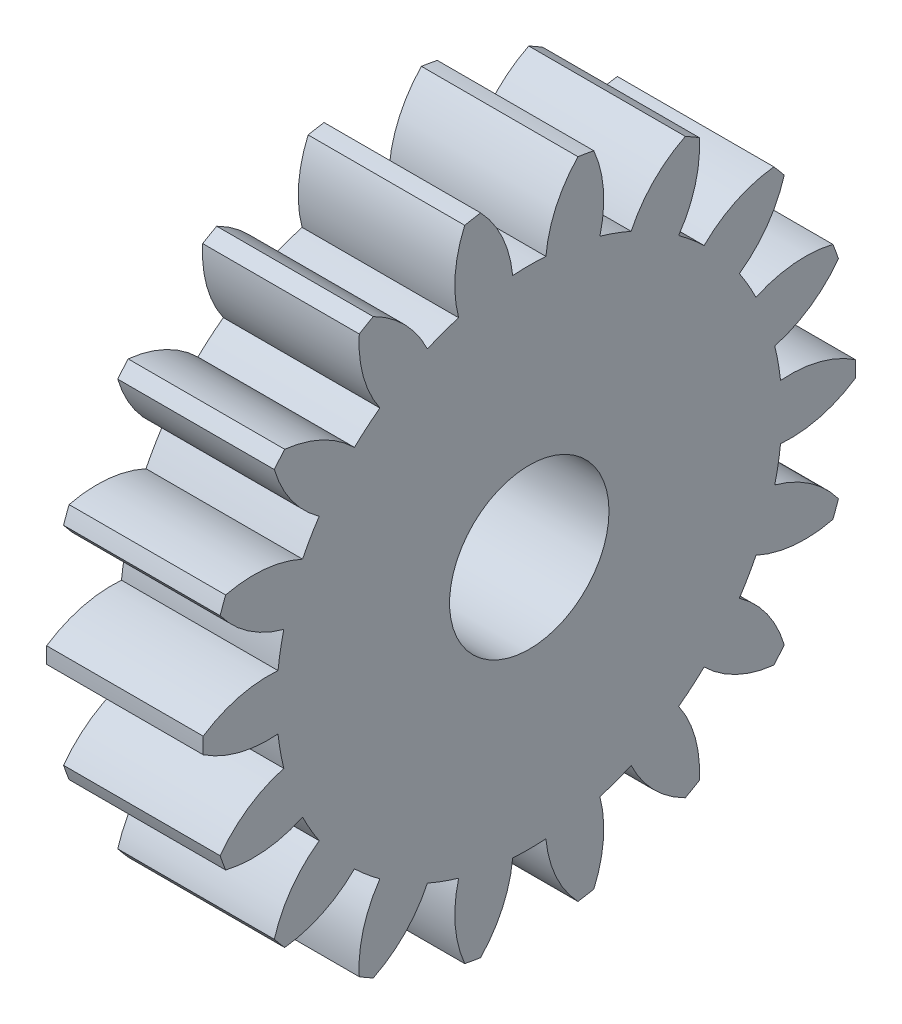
ISO-10303-21;
HEADER;
FILE_DESCRIPTION(('STEP AP214'),'2;1');
FILE_NAME('part.step','',(''),(''),'','','');
FILE_SCHEMA(('AUTOMOTIVE_DESIGN { 1 0 10303 214 1 1 1 1 }'));
ENDSEC;
DATA;
#1=APPLICATION_CONTEXT('core data for automotive mechanical design processes');
#2=APPLICATION_PROTOCOL_DEFINITION('international standard','automotive_design',2000,#1);
#3=PRODUCT_CONTEXT('',#1,'mechanical');
#4=PRODUCT('Part','Part','',(#3));
#5=PRODUCT_RELATED_PRODUCT_CATEGORY('part','',(#4));
#6=PRODUCT_DEFINITION_FORMATION('','',#4);
#7=PRODUCT_DEFINITION_CONTEXT('part definition',#1,'design');
#8=PRODUCT_DEFINITION('design','',#6,#7);
#9=PRODUCT_DEFINITION_SHAPE('','',#8);
#10=(LENGTH_UNIT() NAMED_UNIT(*) SI_UNIT(.MILLI.,.METRE.));
#11=(NAMED_UNIT(*) PLANE_ANGLE_UNIT() SI_UNIT($,.RADIAN.));
#12=(NAMED_UNIT(*) SI_UNIT($,.STERADIAN.) SOLID_ANGLE_UNIT());
#13=UNCERTAINTY_MEASURE_WITH_UNIT(LENGTH_MEASURE(1.E-05),#10,'distance_accuracy_value','');
#14=(GEOMETRIC_REPRESENTATION_CONTEXT(3) GLOBAL_UNCERTAINTY_ASSIGNED_CONTEXT((#13)) GLOBAL_UNIT_ASSIGNED_CONTEXT((#10,
#11,#12)) REPRESENTATION_CONTEXT('',''));
#15=CARTESIAN_POINT('',(0.,0.,0.));
#16=DIRECTION('',(0.,0.,1.));
#17=DIRECTION('',(1.,0.,0.));
#18=AXIS2_PLACEMENT_3D('',#15,#16,#17);
#19=CARTESIAN_POINT('',(-8.37567667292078,0.,0.));
#20=DIRECTION('',(1.,0.,0.));
#21=DIRECTION('',(0.,0.,-1.));
#22=AXIS2_PLACEMENT_3D('',#19,#20,#21);
#23=CYLINDRICAL_SURFACE('',#22,2.75);
#24=CARTESIAN_POINT('',(-2.97567667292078,0.,0.));
#25=DIRECTION('',(1.,0.,0.));
#26=DIRECTION('',(0.,0.,-1.));
#27=AXIS2_PLACEMENT_3D('',#24,#25,#26);
#28=CIRCLE('',#27,2.75);
#29=CARTESIAN_POINT('',(-2.97567667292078,0.,-2.75));
#30=VERTEX_POINT('',#29);
#31=EDGE_CURVE('E528',#30,#30,#28,.T.);
#32=CARTESIAN_POINT('',(-7.37567667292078,0.,0.));
#33=DIRECTION('',(-1.,0.,0.));
#34=DIRECTION('',(0.,0.,1.));
#35=AXIS2_PLACEMENT_3D('',#32,#33,#34);
#36=CIRCLE('',#35,2.75);
#37=CARTESIAN_POINT('',(-7.37567667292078,0.,-2.75));
#38=VERTEX_POINT('',#37);
#39=EDGE_CURVE('E877',#38,#38,#36,.F.);
#40=CARTESIAN_POINT('',(-2.97567667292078,0.,-2.75));
#41=CARTESIAN_POINT('',(-3.02151000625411,0.,-2.75));
#42=CARTESIAN_POINT('',(-3.06734333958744,0.,-2.75));
#43=CARTESIAN_POINT('',(-3.15901000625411,0.,-2.75));
#44=CARTESIAN_POINT('',(-3.20484333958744,0.,-2.75));
#45=CARTESIAN_POINT('',(-3.29651000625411,0.,-2.75));
#46=CARTESIAN_POINT('',(-3.34234333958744,0.,-2.75));
#47=CARTESIAN_POINT('',(-3.43401000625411,0.,-2.75));
#48=CARTESIAN_POINT('',(-3.47984333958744,0.,-2.75));
#49=CARTESIAN_POINT('',(-3.57151000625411,0.,-2.75));
#50=CARTESIAN_POINT('',(-3.61734333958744,0.,-2.75));
#51=CARTESIAN_POINT('',(-3.70901000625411,0.,-2.75));
#52=CARTESIAN_POINT('',(-3.75484333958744,0.,-2.75));
#53=CARTESIAN_POINT('',(-3.84651000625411,0.,-2.75));
#54=CARTESIAN_POINT('',(-3.89234333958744,0.,-2.75));
#55=CARTESIAN_POINT('',(-3.98401000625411,0.,-2.75));
#56=CARTESIAN_POINT('',(-4.02984333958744,0.,-2.75));
#57=CARTESIAN_POINT('',(-4.12151000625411,0.,-2.75));
#58=CARTESIAN_POINT('',(-4.16734333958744,0.,-2.75));
#59=CARTESIAN_POINT('',(-4.25901000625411,0.,-2.75));
#60=CARTESIAN_POINT('',(-4.30484333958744,0.,-2.75));
#61=CARTESIAN_POINT('',(-4.39651000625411,0.,-2.75));
#62=CARTESIAN_POINT('',(-4.44234333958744,0.,-2.75));
#63=CARTESIAN_POINT('',(-4.53401000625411,0.,-2.75));
#64=CARTESIAN_POINT('',(-4.57984333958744,0.,-2.75));
#65=CARTESIAN_POINT('',(-4.67151000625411,0.,-2.75));
#66=CARTESIAN_POINT('',(-4.71734333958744,0.,-2.75));
#67=CARTESIAN_POINT('',(-4.80901000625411,0.,-2.75));
#68=CARTESIAN_POINT('',(-4.85484333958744,0.,-2.75));
#69=CARTESIAN_POINT('',(-4.94651000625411,0.,-2.75));
#70=CARTESIAN_POINT('',(-4.99234333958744,0.,-2.75));
#71=CARTESIAN_POINT('',(-5.08401000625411,0.,-2.75));
#72=CARTESIAN_POINT('',(-5.12984333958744,0.,-2.75));
#73=CARTESIAN_POINT('',(-5.22151000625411,0.,-2.75));
#74=CARTESIAN_POINT('',(-5.26734333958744,0.,-2.75));
#75=CARTESIAN_POINT('',(-5.35901000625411,0.,-2.75));
#76=CARTESIAN_POINT('',(-5.40484333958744,0.,-2.75));
#77=CARTESIAN_POINT('',(-5.49651000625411,0.,-2.75));
#78=CARTESIAN_POINT('',(-5.54234333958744,0.,-2.75));
#79=CARTESIAN_POINT('',(-5.63401000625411,0.,-2.75));
#80=CARTESIAN_POINT('',(-5.67984333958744,0.,-2.75));
#81=CARTESIAN_POINT('',(-5.77151000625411,0.,-2.75));
#82=CARTESIAN_POINT('',(-5.81734333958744,0.,-2.75));
#83=CARTESIAN_POINT('',(-5.90901000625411,0.,-2.75));
#84=CARTESIAN_POINT('',(-5.95484333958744,0.,-2.75));
#85=CARTESIAN_POINT('',(-6.04651000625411,0.,-2.75));
#86=CARTESIAN_POINT('',(-6.09234333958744,0.,-2.75));
#87=CARTESIAN_POINT('',(-6.18401000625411,0.,-2.75));
#88=CARTESIAN_POINT('',(-6.22984333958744,0.,-2.75));
#89=CARTESIAN_POINT('',(-6.32151000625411,0.,-2.75));
#90=CARTESIAN_POINT('',(-6.36734333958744,0.,-2.75));
#91=CARTESIAN_POINT('',(-6.45901000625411,0.,-2.75));
#92=CARTESIAN_POINT('',(-6.50484333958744,0.,-2.75));
#93=CARTESIAN_POINT('',(-6.59651000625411,0.,-2.75));
#94=CARTESIAN_POINT('',(-6.64234333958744,0.,-2.75));
#95=CARTESIAN_POINT('',(-6.73401000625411,0.,-2.75));
#96=CARTESIAN_POINT('',(-6.77984333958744,0.,-2.75));
#97=CARTESIAN_POINT('',(-6.87151000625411,0.,-2.75));
#98=CARTESIAN_POINT('',(-6.91734333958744,0.,-2.75));
#99=CARTESIAN_POINT('',(-7.00901000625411,0.,-2.75));
#100=CARTESIAN_POINT('',(-7.05484333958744,0.,-2.75));
#101=CARTESIAN_POINT('',(-7.14651000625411,0.,-2.75));
#102=CARTESIAN_POINT('',(-7.19234333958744,0.,-2.75));
#103=CARTESIAN_POINT('',(-7.28401000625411,0.,-2.75));
#104=CARTESIAN_POINT('',(-7.32984333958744,0.,-2.75));
#105=CARTESIAN_POINT('',(-7.37567667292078,0.,-2.75));
#106=B_SPLINE_CURVE_WITH_KNOTS('',3,(#40,#41,#42,#43,#44,#45,#46,#47,#48,#49,#50,#51,#52,#53,
#54,#55,#56,#57,#58,#59,#60,#61,#62,#63,#64,#65,#66,#67,#68,#69,#70,#71,#72,#73,#74,#75,#76,#77,
#78,#79,#80,#81,#82,#83,#84,#85,#86,#87,#88,#89,#90,#91,#92,#93,#94,#95,#96,#97,#98,#99,#100,
#101,#102,#103,#104,#105),.UNSPECIFIED.,.F.,.F.,(4,2,2,2,2,2,2,2,2,2,2,2,2,2,2,2,2,2,2,2,2,2,2,
2,2,2,2,2,2,2,2,2,4),(0.,0.1375,0.275,0.4125,0.55,0.6875,0.825,0.9625,1.1,1.2375,1.375,1.5125,
1.65,1.7875,1.925,2.0625,2.2,2.3375,2.475,2.6125,2.75,2.8875,3.025,3.1625,3.3,3.4375,3.575,
3.7125,3.85,3.9875,4.125,4.2625,4.4),.UNSPECIFIED.);
#107=EDGE_CURVE('BSEAM39',#30,#38,#106,.T.);
#108=ORIENTED_EDGE('',*,*,#31,.T.);
#109=ORIENTED_EDGE('',*,*,#39,.F.);
#110=ORIENTED_EDGE('',*,*,#107,.T.);
#111=ORIENTED_EDGE('',*,*,#107,.F.);
#112=EDGE_LOOP('',(#108,#110,#109,#111));
#113=FACE_BOUND('',#112,.T.);
#114=ADVANCED_FACE('F39',(#113),#23,.F.);
#115=CARTESIAN_POINT('',(-8.37567667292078,0.,0.));
#116=DIRECTION('',(1.,0.,0.));
#117=DIRECTION('',(0.,0.,-1.));
#118=AXIS2_PLACEMENT_3D('',#115,#116,#117);
#119=CYLINDRICAL_SURFACE('',#118,11.2499999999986);
#120=CARTESIAN_POINT('',(-2.97567667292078,0.,0.));
#121=DIRECTION('',(1.,0.,0.));
#122=DIRECTION('',(0.,0.,-1.));
#123=AXIS2_PLACEMENT_3D('',#120,#121,#122);
#124=CIRCLE('',#123,11.2499999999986);
#125=CARTESIAN_POINT('',(-2.97567667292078,7.44235849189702,8.4364566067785));
#126=VERTEX_POINT('',#125);
#127=CARTESIAN_POINT('',(-2.97567667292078,7.01593588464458,8.79426765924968));
#128=VERTEX_POINT('',#127);
#129=EDGE_CURVE('E524',#126,#128,#124,.T.);
#130=ORIENTED_EDGE('',*,*,#129,.F.);
#131=DIRECTION('',(1.,0.,0.));
#132=VECTOR('',#131,1.);
#133=CARTESIAN_POINT('',(-8.37567667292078,7.44235849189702,8.4364566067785));
#134=LINE('',#133,#132);
#135=CARTESIAN_POINT('',(-8.37567667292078,7.44235849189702,8.4364566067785));
#136=VERTEX_POINT('',#135);
#137=EDGE_CURVE('E57',#136,#126,#134,.T.);
#138=ORIENTED_EDGE('',*,*,#137,.F.);
#139=CARTESIAN_POINT('',(-8.37567667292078,0.,0.));
#140=DIRECTION('',(1.,0.,0.));
#141=DIRECTION('',(0.,0.,-1.));
#142=AXIS2_PLACEMENT_3D('',#139,#140,#141);
#143=CIRCLE('',#142,11.2499999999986);
#144=CARTESIAN_POINT('',(-8.37567667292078,7.01593588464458,8.79426765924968));
#145=VERTEX_POINT('',#144);
#146=EDGE_CURVE('E738',#136,#145,#143,.T.);
#147=ORIENTED_EDGE('',*,*,#146,.T.);
#148=DIRECTION('',(1.,0.,0.));
#149=VECTOR('',#148,1.);
#150=CARTESIAN_POINT('',(-8.37567667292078,7.01593588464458,8.79426765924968));
#151=LINE('',#150,#149);
#152=EDGE_CURVE('E290',#145,#128,#151,.T.);
#153=ORIENTED_EDGE('',*,*,#152,.T.);
#154=EDGE_LOOP('',(#130,#138,#147,#153));
#155=FACE_BOUND('',#154,.T.);
#156=ADVANCED_FACE('F896',(#155),#119,.T.);
#157=CARTESIAN_POINT('',(-8.37567667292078,3.41669096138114,8.87974086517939));
#158=DIRECTION('',(1.,0.,0.));
#159=DIRECTION('',(0.,0.,-1.));
#160=AXIS2_PLACEMENT_3D('',#157,#158,#159);
#161=CYLINDRICAL_SURFACE('',#160,4.04999999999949);
#162=CARTESIAN_POINT('',(-2.97567667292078,3.41669096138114,8.87974086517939));
#163=DIRECTION('',(1.,0.,0.));
#164=DIRECTION('',(0.,0.,-1.));
#165=AXIS2_PLACEMENT_3D('',#162,#163,#164);
#166=CIRCLE('',#165,4.04999999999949);
#167=CARTESIAN_POINT('',(-2.97567667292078,6.29518153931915,6.0307424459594));
#168=VERTEX_POINT('',#167);
#169=EDGE_CURVE('E735',#168,#126,#166,.T.);
#170=ORIENTED_EDGE('',*,*,#169,.F.);
#171=DIRECTION('',(1.,0.,0.));
#172=VECTOR('',#171,1.);
#173=CARTESIAN_POINT('',(-8.37567667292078,6.29518153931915,6.0307424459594));
#174=LINE('',#173,#172);
#175=CARTESIAN_POINT('',(-8.37567667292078,6.29518153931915,6.0307424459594));
#176=VERTEX_POINT('',#175);
#177=EDGE_CURVE('E278',#176,#168,#174,.T.);
#178=ORIENTED_EDGE('',*,*,#177,.F.);
#179=CARTESIAN_POINT('',(-8.37567667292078,3.41669096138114,8.87974086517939));
#180=DIRECTION('',(1.,0.,0.));
#181=DIRECTION('',(0.,0.,-1.));
#182=AXIS2_PLACEMENT_3D('',#179,#180,#181);
#183=CIRCLE('',#182,4.04999999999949);
#184=EDGE_CURVE('E514',#176,#136,#183,.T.);
#185=ORIENTED_EDGE('',*,*,#184,.T.);
#186=ORIENTED_EDGE('',*,*,#137,.T.);
#187=EDGE_LOOP('',(#170,#178,#185,#186));
#188=FACE_BOUND('',#187,.T.);
#189=ADVANCED_FACE('F902',(#188),#161,.T.);
#190=CARTESIAN_POINT('',(-8.37567667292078,0.,0.));
#191=DIRECTION('',(1.,0.,0.));
#192=DIRECTION('',(0.,0.,-1.));
#193=AXIS2_PLACEMENT_3D('',#190,#191,#192);
#194=CYLINDRICAL_SURFACE('',#193,8.71774999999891);
#195=CARTESIAN_POINT('',(-2.97567667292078,0.,0.));
#196=DIRECTION('',(1.,0.,0.));
#197=DIRECTION('',(0.,0.,-1.));
#198=AXIS2_PLACEMENT_3D('',#195,#196,#197);
#199=CIRCLE('',#198,8.71774999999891);
#200=CARTESIAN_POINT('',(-2.97567667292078,7.03226871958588,5.15231615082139));
#201=VERTEX_POINT('',#200);
#202=EDGE_CURVE('E501',#201,#168,#199,.T.);
#203=ORIENTED_EDGE('',*,*,#202,.F.);
#204=DIRECTION('',(1.,0.,0.));
#205=VECTOR('',#204,1.);
#206=CARTESIAN_POINT('',(-8.37567667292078,7.03226871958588,5.15231615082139));
#207=LINE('',#206,#205);
#208=CARTESIAN_POINT('',(-8.37567667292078,7.03226871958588,5.15231615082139));
#209=VERTEX_POINT('',#208);
#210=EDGE_CURVE('E496',#209,#201,#207,.T.);
#211=ORIENTED_EDGE('',*,*,#210,.F.);
#212=CARTESIAN_POINT('',(-8.37567667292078,0.,0.));
#213=DIRECTION('',(1.,0.,0.));
#214=DIRECTION('',(0.,0.,-1.));
#215=AXIS2_PLACEMENT_3D('',#212,#213,#214);
#216=CIRCLE('',#215,8.71774999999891);
#217=EDGE_CURVE('E499',#209,#176,#216,.T.);
#218=ORIENTED_EDGE('',*,*,#217,.T.);
#219=ORIENTED_EDGE('',*,*,#177,.T.);
#220=EDGE_LOOP('',(#203,#211,#218,#219));
#221=FACE_BOUND('',#220,.T.);
#222=ADVANCED_FACE('F498',(#221),#194,.T.);
#223=CARTESIAN_POINT('',(-8.37567667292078,9.3381398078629,1.82283292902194));
#224=DIRECTION('',(1.,0.,0.));
#225=DIRECTION('',(0.,0.,-1.));
#226=AXIS2_PLACEMENT_3D('',#223,#224,#225);
#227=CYLINDRICAL_SURFACE('',#226,4.04999999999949);
#228=CARTESIAN_POINT('',(-2.97567667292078,9.3381398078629,1.82283292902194));
#229=DIRECTION('',(1.,0.,0.));
#230=DIRECTION('',(0.,0.,-1.));
#231=AXIS2_PLACEMENT_3D('',#228,#229,#230);
#232=CIRCLE('',#231,4.04999999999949);
#233=CARTESIAN_POINT('',(-2.97567667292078,9.60063986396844,5.86431702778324));
#234=VERTEX_POINT('',#233);
#235=EDGE_CURVE('E732',#234,#201,#232,.T.);
#236=ORIENTED_EDGE('',*,*,#235,.F.);
#237=DIRECTION('',(1.,0.,0.));
#238=VECTOR('',#237,1.);
#239=CARTESIAN_POINT('',(-8.37567667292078,9.60063986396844,5.86431702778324));
#240=LINE('',#239,#238);
#241=CARTESIAN_POINT('',(-8.37567667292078,9.60063986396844,5.86431702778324));
#242=VERTEX_POINT('',#241);
#243=EDGE_CURVE('E506',#242,#234,#240,.T.);
#244=ORIENTED_EDGE('',*,*,#243,.F.);
#245=CARTESIAN_POINT('',(-8.37567667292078,9.3381398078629,1.82283292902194));
#246=DIRECTION('',(1.,0.,0.));
#247=DIRECTION('',(0.,0.,-1.));
#248=AXIS2_PLACEMENT_3D('',#245,#246,#247);
#249=CIRCLE('',#248,4.04999999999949);
#250=EDGE_CURVE('E512',#242,#209,#249,.T.);
#251=ORIENTED_EDGE('',*,*,#250,.T.);
#252=ORIENTED_EDGE('',*,*,#210,.T.);
#253=EDGE_LOOP('',(#236,#244,#251,#252));
#254=FACE_BOUND('',#253,.T.);
#255=ADVANCED_FACE('F516',(#254),#227,.T.);
#256=CARTESIAN_POINT('',(-8.37567667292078,0.,0.));
#257=DIRECTION('',(1.,0.,0.));
#258=DIRECTION('',(0.,0.,-1.));
#259=AXIS2_PLACEMENT_3D('',#256,#257,#258);
#260=CYLINDRICAL_SURFACE('',#259,11.2499999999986);
#261=CARTESIAN_POINT('',(-2.97567667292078,0.,0.));
#262=DIRECTION('',(1.,0.,0.));
#263=DIRECTION('',(0.,0.,-1.));
#264=AXIS2_PLACEMENT_3D('',#261,#262,#263);
#265=CIRCLE('',#264,11.2499999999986);
#266=CARTESIAN_POINT('',(-2.97567667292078,9.87896745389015,5.38223950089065));
#267=VERTEX_POINT('',#266);
#268=EDGE_CURVE('E729',#267,#234,#265,.T.);
#269=ORIENTED_EDGE('',*,*,#268,.F.);
#270=DIRECTION('',(1.,0.,0.));
#271=VECTOR('',#270,1.);
#272=CARTESIAN_POINT('',(-8.37567667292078,9.87896745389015,5.38223950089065));
#273=LINE('',#272,#271);
#274=CARTESIAN_POINT('',(-8.37567667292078,9.87896745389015,5.38223950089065));
#275=VERTEX_POINT('',#274);
#276=EDGE_CURVE('E742',#275,#267,#273,.T.);
#277=ORIENTED_EDGE('',*,*,#276,.F.);
#278=CARTESIAN_POINT('',(-8.37567667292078,0.,0.));
#279=DIRECTION('',(1.,0.,0.));
#280=DIRECTION('',(0.,0.,-1.));
#281=AXIS2_PLACEMENT_3D('',#278,#279,#280);
#282=CIRCLE('',#281,11.2499999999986);
#283=EDGE_CURVE('E517',#275,#242,#282,.T.);
#284=ORIENTED_EDGE('',*,*,#283,.T.);
#285=ORIENTED_EDGE('',*,*,#243,.T.);
#286=EDGE_LOOP('',(#269,#277,#284,#285));
#287=FACE_BOUND('',#286,.T.);
#288=ADVANCED_FACE('F921',(#287),#260,.T.);
#289=CARTESIAN_POINT('',(-8.37567667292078,6.24768952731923,7.17564983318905));
#290=DIRECTION('',(1.,0.,0.));
#291=DIRECTION('',(0.,0.,-1.));
#292=AXIS2_PLACEMENT_3D('',#289,#290,#291);
#293=CYLINDRICAL_SURFACE('',#292,4.04999999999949);
#294=CARTESIAN_POINT('',(-2.97567667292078,6.24768952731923,7.17564983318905));
#295=DIRECTION('',(1.,0.,0.));
#296=DIRECTION('',(0.,0.,-1.));
#297=AXIS2_PLACEMENT_3D('',#294,#295,#296);
#298=CIRCLE('',#297,4.04999999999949);
#299=CARTESIAN_POINT('',(-2.97567667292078,7.97817103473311,3.51396528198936));
#300=VERTEX_POINT('',#299);
#301=EDGE_CURVE('E726',#300,#267,#298,.T.);
#302=ORIENTED_EDGE('',*,*,#301,.F.);
#303=DIRECTION('',(1.,0.,0.));
#304=VECTOR('',#303,1.);
#305=CARTESIAN_POINT('',(-8.37567667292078,7.97817103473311,3.51396528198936));
#306=LINE('',#305,#304);
#307=CARTESIAN_POINT('',(-8.37567667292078,7.97817103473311,3.51396528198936));
#308=VERTEX_POINT('',#307);
#309=EDGE_CURVE('E744',#308,#300,#306,.T.);
#310=ORIENTED_EDGE('',*,*,#309,.F.);
#311=CARTESIAN_POINT('',(-8.37567667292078,6.24768952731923,7.17564983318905));
#312=DIRECTION('',(1.,0.,0.));
#313=DIRECTION('',(0.,0.,-1.));
#314=AXIS2_PLACEMENT_3D('',#311,#312,#313);
#315=CIRCLE('',#314,4.04999999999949);
#316=EDGE_CURVE('E519',#308,#275,#315,.T.);
#317=ORIENTED_EDGE('',*,*,#316,.T.);
#318=ORIENTED_EDGE('',*,*,#276,.T.);
#319=EDGE_LOOP('',(#302,#310,#317,#318));
#320=FACE_BOUND('',#319,.T.);
#321=ADVANCED_FACE('F924',(#320),#293,.T.);
#322=CARTESIAN_POINT('',(-8.37567667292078,0.,0.));
#323=DIRECTION('',(1.,0.,0.));
#324=DIRECTION('',(0.,0.,-1.));
#325=AXIS2_PLACEMENT_3D('',#322,#323,#324);
#326=CYLINDRICAL_SURFACE('',#325,8.71774999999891);
#327=CARTESIAN_POINT('',(-2.97567667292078,0.,0.));
#328=DIRECTION('',(1.,0.,0.));
#329=DIRECTION('',(0.,0.,-1.));
#330=AXIS2_PLACEMENT_3D('',#327,#328,#329);
#331=CIRCLE('',#330,8.71774999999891);
#332=CARTESIAN_POINT('',(-2.97567667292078,8.37036693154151,2.43641591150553));
#333=VERTEX_POINT('',#332);
#334=EDGE_CURVE('E723',#333,#300,#331,.T.);
#335=ORIENTED_EDGE('',*,*,#334,.F.);
#336=DIRECTION('',(1.,0.,0.));
#337=VECTOR('',#336,1.);
#338=CARTESIAN_POINT('',(-8.37567667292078,8.37036693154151,2.43641591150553));
#339=LINE('',#338,#337);
#340=CARTESIAN_POINT('',(-8.37567667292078,8.37036693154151,2.43641591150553));
#341=VERTEX_POINT('',#340);
#342=EDGE_CURVE('E746',#341,#333,#339,.T.);
#343=ORIENTED_EDGE('',*,*,#342,.F.);
#344=CARTESIAN_POINT('',(-8.37567667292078,0.,0.));
#345=DIRECTION('',(1.,0.,0.));
#346=DIRECTION('',(0.,0.,-1.));
#347=AXIS2_PLACEMENT_3D('',#344,#345,#346);
#348=CIRCLE('',#347,8.71774999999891);
#349=EDGE_CURVE('E1391',#341,#308,#348,.T.);
#350=ORIENTED_EDGE('',*,*,#349,.T.);
#351=ORIENTED_EDGE('',*,*,#309,.T.);
#352=EDGE_LOOP('',(#335,#343,#350,#351));
#353=FACE_BOUND('',#352,.T.);
#354=ADVANCED_FACE('F928',(#353),#326,.T.);
#355=CARTESIAN_POINT('',(-8.37567667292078,9.39842664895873,-1.48092926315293));
#356=DIRECTION('',(1.,0.,0.));
#357=DIRECTION('',(0.,0.,-1.));
#358=AXIS2_PLACEMENT_3D('',#355,#356,#357);
#359=CYLINDRICAL_SURFACE('',#358,4.04999999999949);
#360=CARTESIAN_POINT('',(-2.97567667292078,9.39842664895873,-1.48092926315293));
#361=DIRECTION('',(1.,0.,0.));
#362=DIRECTION('',(0.,0.,-1.));
#363=AXIS2_PLACEMENT_3D('',#360,#361,#362);
#364=CIRCLE('',#363,4.04999999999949);
#365=CARTESIAN_POINT('',(-2.97567667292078,11.0273649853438,2.22704321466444));
#366=VERTEX_POINT('',#365);
#367=EDGE_CURVE('E720',#366,#333,#364,.T.);
#368=ORIENTED_EDGE('',*,*,#367,.F.);
#369=DIRECTION('',(1.,0.,0.));
#370=VECTOR('',#369,1.);
#371=CARTESIAN_POINT('',(-8.37567667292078,11.0273649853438,2.22704321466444));
#372=LINE('',#371,#370);
#373=CARTESIAN_POINT('',(-8.37567667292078,11.0273649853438,2.22704321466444));
#374=VERTEX_POINT('',#373);
#375=EDGE_CURVE('E748',#374,#366,#372,.T.);
#376=ORIENTED_EDGE('',*,*,#375,.F.);
#377=CARTESIAN_POINT('',(-8.37567667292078,9.39842664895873,-1.48092926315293));
#378=DIRECTION('',(1.,0.,0.));
#379=DIRECTION('',(0.,0.,-1.));
#380=AXIS2_PLACEMENT_3D('',#377,#378,#379);
#381=CIRCLE('',#380,4.04999999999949);
#382=EDGE_CURVE('E1388',#374,#341,#381,.T.);
#383=ORIENTED_EDGE('',*,*,#382,.T.);
#384=ORIENTED_EDGE('',*,*,#342,.T.);
#385=EDGE_LOOP('',(#368,#376,#383,#384));
#386=FACE_BOUND('',#385,.T.);
#387=ADVANCED_FACE('F932',(#386),#359,.T.);
#388=CARTESIAN_POINT('',(-8.37567667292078,0.,0.));
#389=DIRECTION('',(1.,0.,0.));
#390=DIRECTION('',(0.,0.,-1.));
#391=AXIS2_PLACEMENT_3D('',#388,#389,#390);
#392=CYLINDRICAL_SURFACE('',#391,11.2499999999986);
#393=CARTESIAN_POINT('',(-2.97567667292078,0.,0.));
#394=DIRECTION('',(1.,0.,0.));
#395=DIRECTION('',(0.,0.,-1.));
#396=AXIS2_PLACEMENT_3D('',#393,#394,#395);
#397=CIRCLE('',#396,11.2499999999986);
#398=CARTESIAN_POINT('',(-2.97567667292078,11.1240271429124,1.67884487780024));
#399=VERTEX_POINT('',#398);
#400=EDGE_CURVE('E717',#399,#366,#397,.T.);
#401=ORIENTED_EDGE('',*,*,#400,.F.);
#402=DIRECTION('',(1.,0.,0.));
#403=VECTOR('',#402,1.);
#404=CARTESIAN_POINT('',(-8.37567667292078,11.1240271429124,1.67884487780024));
#405=LINE('',#404,#403);
#406=CARTESIAN_POINT('',(-8.37567667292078,11.1240271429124,1.67884487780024));
#407=VERTEX_POINT('',#406);
#408=EDGE_CURVE('E750',#407,#399,#405,.T.);
#409=ORIENTED_EDGE('',*,*,#408,.F.);
#410=CARTESIAN_POINT('',(-8.37567667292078,0.,0.));
#411=DIRECTION('',(1.,0.,0.));
#412=DIRECTION('',(0.,0.,-1.));
#413=AXIS2_PLACEMENT_3D('',#410,#411,#412);
#414=CIRCLE('',#413,11.2499999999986);
#415=EDGE_CURVE('E1385',#407,#374,#414,.T.);
#416=ORIENTED_EDGE('',*,*,#415,.T.);
#417=ORIENTED_EDGE('',*,*,#375,.T.);
#418=EDGE_LOOP('',(#401,#409,#416,#417));
#419=FACE_BOUND('',#418,.T.);
#420=ADVANCED_FACE('F936',(#419),#392,.T.);
#421=CARTESIAN_POINT('',(-8.37567667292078,8.32512453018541,4.60606953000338));
#422=DIRECTION('',(1.,0.,0.));
#423=DIRECTION('',(0.,0.,-1.));
#424=AXIS2_PLACEMENT_3D('',#421,#422,#423);
#425=CYLINDRICAL_SURFACE('',#424,4.04999999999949);
#426=CARTESIAN_POINT('',(-2.97567667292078,8.32512453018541,4.60606953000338));
#427=DIRECTION('',(1.,0.,0.));
#428=DIRECTION('',(0.,0.,-1.));
#429=AXIS2_PLACEMENT_3D('',#426,#427,#428);
#430=CIRCLE('',#429,4.04999999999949);
#431=CARTESIAN_POINT('',(-2.97567667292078,8.69887535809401,0.573352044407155));
#432=VERTEX_POINT('',#431);
#433=EDGE_CURVE('E714',#432,#399,#430,.T.);
#434=ORIENTED_EDGE('',*,*,#433,.F.);
#435=DIRECTION('',(1.,0.,0.));
#436=VECTOR('',#435,1.);
#437=CARTESIAN_POINT('',(-8.37567667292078,8.69887535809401,0.573352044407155));
#438=LINE('',#437,#436);
#439=CARTESIAN_POINT('',(-8.37567667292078,8.69887535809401,0.573352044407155));
#440=VERTEX_POINT('',#439);
#441=EDGE_CURVE('E752',#440,#432,#438,.T.);
#442=ORIENTED_EDGE('',*,*,#441,.F.);
#443=CARTESIAN_POINT('',(-8.37567667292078,8.32512453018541,4.60606953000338));
#444=DIRECTION('',(1.,0.,0.));
#445=DIRECTION('',(0.,0.,-1.));
#446=AXIS2_PLACEMENT_3D('',#443,#444,#445);
#447=CIRCLE('',#446,4.04999999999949);
#448=EDGE_CURVE('E1382',#440,#407,#447,.T.);
#449=ORIENTED_EDGE('',*,*,#448,.T.);
#450=ORIENTED_EDGE('',*,*,#408,.T.);
#451=EDGE_LOOP('',(#434,#442,#449,#450));
#452=FACE_BOUND('',#451,.T.);
#453=ADVANCED_FACE('F940',(#452),#425,.T.);
#454=CARTESIAN_POINT('',(-8.37567667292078,0.,0.));
#455=DIRECTION('',(1.,0.,0.));
#456=DIRECTION('',(0.,0.,-1.));
#457=AXIS2_PLACEMENT_3D('',#454,#455,#456);
#458=CYLINDRICAL_SURFACE('',#457,8.71774999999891);
#459=CARTESIAN_POINT('',(-2.97567667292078,0.,0.));
#460=DIRECTION('',(1.,0.,0.));
#461=DIRECTION('',(0.,0.,-1.));
#462=AXIS2_PLACEMENT_3D('',#459,#460,#461);
#463=CIRCLE('',#462,8.71774999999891);
#464=CARTESIAN_POINT('',(-2.97567667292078,8.69887535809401,-0.573352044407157));
#465=VERTEX_POINT('',#464);
#466=EDGE_CURVE('E711',#465,#432,#463,.T.);
#467=ORIENTED_EDGE('',*,*,#466,.F.);
#468=DIRECTION('',(1.,0.,0.));
#469=VECTOR('',#468,1.);
#470=CARTESIAN_POINT('',(-8.37567667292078,8.69887535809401,-0.573352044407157));
#471=LINE('',#470,#469);
#472=CARTESIAN_POINT('',(-8.37567667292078,8.69887535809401,-0.573352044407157));
#473=VERTEX_POINT('',#472);
#474=EDGE_CURVE('E754',#473,#465,#471,.T.);
#475=ORIENTED_EDGE('',*,*,#474,.F.);
#476=CARTESIAN_POINT('',(-8.37567667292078,0.,0.));
#477=DIRECTION('',(1.,0.,0.));
#478=DIRECTION('',(0.,0.,-1.));
#479=AXIS2_PLACEMENT_3D('',#476,#477,#478);
#480=CIRCLE('',#479,8.71774999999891);
#481=EDGE_CURVE('E1379',#473,#440,#480,.T.);
#482=ORIENTED_EDGE('',*,*,#481,.T.);
#483=ORIENTED_EDGE('',*,*,#441,.T.);
#484=EDGE_LOOP('',(#467,#475,#482,#483));
#485=FACE_BOUND('',#484,.T.);
#486=ADVANCED_FACE('F944',(#485),#458,.T.);
#487=CARTESIAN_POINT('',(-8.37567667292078,8.32512453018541,-4.60606953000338));
#488=DIRECTION('',(1.,0.,0.));
#489=DIRECTION('',(0.,0.,-1.));
#490=AXIS2_PLACEMENT_3D('',#487,#488,#489);
#491=CYLINDRICAL_SURFACE('',#490,4.04999999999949);
#492=CARTESIAN_POINT('',(-2.97567667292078,8.32512453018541,-4.60606953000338));
#493=DIRECTION('',(1.,0.,0.));
#494=DIRECTION('',(0.,0.,-1.));
#495=AXIS2_PLACEMENT_3D('',#492,#493,#494);
#496=CIRCLE('',#495,4.04999999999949);
#497=CARTESIAN_POINT('',(-2.97567667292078,11.1240271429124,-1.67884487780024));
#498=VERTEX_POINT('',#497);
#499=EDGE_CURVE('E708',#498,#465,#496,.T.);
#500=ORIENTED_EDGE('',*,*,#499,.F.);
#501=DIRECTION('',(1.,0.,0.));
#502=VECTOR('',#501,1.);
#503=CARTESIAN_POINT('',(-8.37567667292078,11.1240271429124,-1.67884487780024));
#504=LINE('',#503,#502);
#505=CARTESIAN_POINT('',(-8.37567667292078,11.1240271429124,-1.67884487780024));
#506=VERTEX_POINT('',#505);
#507=EDGE_CURVE('E756',#506,#498,#504,.T.);
#508=ORIENTED_EDGE('',*,*,#507,.F.);
#509=CARTESIAN_POINT('',(-8.37567667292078,8.32512453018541,-4.60606953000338));
#510=DIRECTION('',(1.,0.,0.));
#511=DIRECTION('',(0.,0.,-1.));
#512=AXIS2_PLACEMENT_3D('',#509,#510,#511);
#513=CIRCLE('',#512,4.04999999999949);
#514=EDGE_CURVE('E1376',#506,#473,#513,.T.);
#515=ORIENTED_EDGE('',*,*,#514,.T.);
#516=ORIENTED_EDGE('',*,*,#474,.T.);
#517=EDGE_LOOP('',(#500,#508,#515,#516));
#518=FACE_BOUND('',#517,.T.);
#519=ADVANCED_FACE('F948',(#518),#491,.T.);
#520=CARTESIAN_POINT('',(-8.37567667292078,0.,0.));
#521=DIRECTION('',(1.,0.,0.));
#522=DIRECTION('',(0.,0.,-1.));
#523=AXIS2_PLACEMENT_3D('',#520,#521,#522);
#524=CYLINDRICAL_SURFACE('',#523,11.2499999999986);
#525=CARTESIAN_POINT('',(-2.97567667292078,0.,0.));
#526=DIRECTION('',(1.,0.,0.));
#527=DIRECTION('',(0.,0.,-1.));
#528=AXIS2_PLACEMENT_3D('',#525,#526,#527);
#529=CIRCLE('',#528,11.2499999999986);
#530=CARTESIAN_POINT('',(-2.97567667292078,11.0273649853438,-2.22704321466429));
#531=VERTEX_POINT('',#530);
#532=EDGE_CURVE('E705',#531,#498,#529,.T.);
#533=ORIENTED_EDGE('',*,*,#532,.F.);
#534=DIRECTION('',(1.,0.,0.));
#535=VECTOR('',#534,1.);
#536=CARTESIAN_POINT('',(-8.37567667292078,11.0273649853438,-2.22704321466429));
#537=LINE('',#536,#535);
#538=CARTESIAN_POINT('',(-8.37567667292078,11.0273649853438,-2.22704321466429));
#539=VERTEX_POINT('',#538);
#540=EDGE_CURVE('E758',#539,#531,#537,.T.);
#541=ORIENTED_EDGE('',*,*,#540,.F.);
#542=CARTESIAN_POINT('',(-8.37567667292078,0.,0.));
#543=DIRECTION('',(1.,0.,0.));
#544=DIRECTION('',(0.,0.,-1.));
#545=AXIS2_PLACEMENT_3D('',#542,#543,#544);
#546=CIRCLE('',#545,11.2499999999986);
#547=EDGE_CURVE('E1373',#539,#506,#546,.T.);
#548=ORIENTED_EDGE('',*,*,#547,.T.);
#549=ORIENTED_EDGE('',*,*,#507,.T.);
#550=EDGE_LOOP('',(#533,#541,#548,#549));
#551=FACE_BOUND('',#550,.T.);
#552=ADVANCED_FACE('F952',(#551),#524,.T.);
#553=CARTESIAN_POINT('',(-8.37567667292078,9.39842664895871,1.48092926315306));
#554=DIRECTION('',(1.,0.,0.));
#555=DIRECTION('',(0.,0.,-1.));
#556=AXIS2_PLACEMENT_3D('',#553,#554,#555);
#557=CYLINDRICAL_SURFACE('',#556,4.04999999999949);
#558=CARTESIAN_POINT('',(-2.97567667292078,9.39842664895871,1.48092926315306));
#559=DIRECTION('',(1.,0.,0.));
#560=DIRECTION('',(0.,0.,-1.));
#561=AXIS2_PLACEMENT_3D('',#558,#559,#560);
#562=CIRCLE('',#561,4.04999999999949);
#563=CARTESIAN_POINT('',(-2.97567667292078,8.37036693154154,-2.43641591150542));
#564=VERTEX_POINT('',#563);
#565=EDGE_CURVE('E702',#564,#531,#562,.T.);
#566=ORIENTED_EDGE('',*,*,#565,.F.);
#567=DIRECTION('',(1.,0.,0.));
#568=VECTOR('',#567,1.);
#569=CARTESIAN_POINT('',(-8.37567667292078,8.37036693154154,-2.43641591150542));
#570=LINE('',#569,#568);
#571=CARTESIAN_POINT('',(-8.37567667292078,8.37036693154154,-2.43641591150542));
#572=VERTEX_POINT('',#571);
#573=EDGE_CURVE('E760',#572,#564,#570,.T.);
#574=ORIENTED_EDGE('',*,*,#573,.F.);
#575=CARTESIAN_POINT('',(-8.37567667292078,9.39842664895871,1.48092926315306));
#576=DIRECTION('',(1.,0.,0.));
#577=DIRECTION('',(0.,0.,-1.));
#578=AXIS2_PLACEMENT_3D('',#575,#576,#577);
#579=CIRCLE('',#578,4.04999999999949);
#580=EDGE_CURVE('E1370',#572,#539,#579,.T.);
#581=ORIENTED_EDGE('',*,*,#580,.T.);
#582=ORIENTED_EDGE('',*,*,#540,.T.);
#583=EDGE_LOOP('',(#566,#574,#581,#582));
#584=FACE_BOUND('',#583,.T.);
#585=ADVANCED_FACE('F956',(#584),#557,.T.);
#586=CARTESIAN_POINT('',(-8.37567667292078,0.,0.));
#587=DIRECTION('',(1.,0.,0.));
#588=DIRECTION('',(0.,0.,-1.));
#589=AXIS2_PLACEMENT_3D('',#586,#587,#588);
#590=CYLINDRICAL_SURFACE('',#589,8.71774999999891);
#591=CARTESIAN_POINT('',(-2.97567667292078,0.,0.));
#592=DIRECTION('',(1.,0.,0.));
#593=DIRECTION('',(0.,0.,-1.));
#594=AXIS2_PLACEMENT_3D('',#591,#592,#593);
#595=CIRCLE('',#594,8.71774999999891);
#596=CARTESIAN_POINT('',(-2.97567667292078,7.97817103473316,-3.51396528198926));
#597=VERTEX_POINT('',#596);
#598=EDGE_CURVE('E699',#597,#564,#595,.T.);
#599=ORIENTED_EDGE('',*,*,#598,.F.);
#600=DIRECTION('',(1.,0.,0.));
#601=VECTOR('',#600,1.);
#602=CARTESIAN_POINT('',(-8.37567667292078,7.97817103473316,-3.51396528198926));
#603=LINE('',#602,#601);
#604=CARTESIAN_POINT('',(-8.37567667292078,7.97817103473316,-3.51396528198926));
#605=VERTEX_POINT('',#604);
#606=EDGE_CURVE('E762',#605,#597,#603,.T.);
#607=ORIENTED_EDGE('',*,*,#606,.F.);
#608=CARTESIAN_POINT('',(-8.37567667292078,0.,0.));
#609=DIRECTION('',(1.,0.,0.));
#610=DIRECTION('',(0.,0.,-1.));
#611=AXIS2_PLACEMENT_3D('',#608,#609,#610);
#612=CIRCLE('',#611,8.71774999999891);
#613=EDGE_CURVE('E1367',#605,#572,#612,.T.);
#614=ORIENTED_EDGE('',*,*,#613,.T.);
#615=ORIENTED_EDGE('',*,*,#573,.T.);
#616=EDGE_LOOP('',(#599,#607,#614,#615));
#617=FACE_BOUND('',#616,.T.);
#618=ADVANCED_FACE('F960',(#617),#590,.T.);
#619=CARTESIAN_POINT('',(-8.37567667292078,6.24768952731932,-7.17564983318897));
#620=DIRECTION('',(1.,0.,0.));
#621=DIRECTION('',(0.,0.,-1.));
#622=AXIS2_PLACEMENT_3D('',#619,#620,#621);
#623=CYLINDRICAL_SURFACE('',#622,4.04999999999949);
#624=CARTESIAN_POINT('',(-2.97567667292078,6.24768952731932,-7.17564983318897));
#625=DIRECTION('',(1.,0.,0.));
#626=DIRECTION('',(0.,0.,-1.));
#627=AXIS2_PLACEMENT_3D('',#624,#625,#626);
#628=CIRCLE('',#627,4.04999999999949);
#629=CARTESIAN_POINT('',(-2.97567667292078,9.87896745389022,-5.38223950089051));
#630=VERTEX_POINT('',#629);
#631=EDGE_CURVE('E696',#630,#597,#628,.T.);
#632=ORIENTED_EDGE('',*,*,#631,.F.);
#633=DIRECTION('',(1.,0.,0.));
#634=VECTOR('',#633,1.);
#635=CARTESIAN_POINT('',(-8.37567667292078,9.87896745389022,-5.38223950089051));
#636=LINE('',#635,#634);
#637=CARTESIAN_POINT('',(-8.37567667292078,9.87896745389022,-5.38223950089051));
#638=VERTEX_POINT('',#637);
#639=EDGE_CURVE('E764',#638,#630,#636,.T.);
#640=ORIENTED_EDGE('',*,*,#639,.F.);
#641=CARTESIAN_POINT('',(-8.37567667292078,6.24768952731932,-7.17564983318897));
#642=DIRECTION('',(1.,0.,0.));
#643=DIRECTION('',(0.,0.,-1.));
#644=AXIS2_PLACEMENT_3D('',#641,#642,#643);
#645=CIRCLE('',#644,4.04999999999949);
#646=EDGE_CURVE('E1364',#638,#605,#645,.T.);
#647=ORIENTED_EDGE('',*,*,#646,.T.);
#648=ORIENTED_EDGE('',*,*,#606,.T.);
#649=EDGE_LOOP('',(#632,#640,#647,#648));
#650=FACE_BOUND('',#649,.T.);
#651=ADVANCED_FACE('F964',(#650),#623,.T.);
#652=CARTESIAN_POINT('',(-8.37567667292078,0.,0.));
#653=DIRECTION('',(1.,0.,0.));
#654=DIRECTION('',(0.,0.,-1.));
#655=AXIS2_PLACEMENT_3D('',#652,#653,#654);
#656=CYLINDRICAL_SURFACE('',#655,11.2499999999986);
#657=CARTESIAN_POINT('',(-2.97567667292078,0.,0.));
#658=DIRECTION('',(1.,0.,0.));
#659=DIRECTION('',(0.,0.,-1.));
#660=AXIS2_PLACEMENT_3D('',#657,#658,#659);
#661=CIRCLE('',#660,11.2499999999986);
#662=CARTESIAN_POINT('',(-2.97567667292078,9.60063986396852,-5.86431702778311));
#663=VERTEX_POINT('',#662);
#664=EDGE_CURVE('E693',#663,#630,#661,.T.);
#665=ORIENTED_EDGE('',*,*,#664,.F.);
#666=DIRECTION('',(1.,0.,0.));
#667=VECTOR('',#666,1.);
#668=CARTESIAN_POINT('',(-8.37567667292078,9.60063986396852,-5.86431702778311));
#669=LINE('',#668,#667);
#670=CARTESIAN_POINT('',(-8.37567667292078,9.60063986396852,-5.86431702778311));
#671=VERTEX_POINT('',#670);
#672=EDGE_CURVE('E766',#671,#663,#669,.T.);
#673=ORIENTED_EDGE('',*,*,#672,.F.);
#674=CARTESIAN_POINT('',(-8.37567667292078,0.,0.));
#675=DIRECTION('',(1.,0.,0.));
#676=DIRECTION('',(0.,0.,-1.));
#677=AXIS2_PLACEMENT_3D('',#674,#675,#676);
#678=CIRCLE('',#677,11.2499999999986);
#679=EDGE_CURVE('E1361',#671,#638,#678,.T.);
#680=ORIENTED_EDGE('',*,*,#679,.T.);
#681=ORIENTED_EDGE('',*,*,#639,.T.);
#682=EDGE_LOOP('',(#665,#673,#680,#681));
#683=FACE_BOUND('',#682,.T.);
#684=ADVANCED_FACE('F968',(#683),#656,.T.);
#685=CARTESIAN_POINT('',(-8.37567667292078,9.33813980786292,-1.82283292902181));
#686=DIRECTION('',(1.,0.,0.));
#687=DIRECTION('',(0.,0.,-1.));
#688=AXIS2_PLACEMENT_3D('',#685,#686,#687);
#689=CYLINDRICAL_SURFACE('',#688,4.04999999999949);
#690=CARTESIAN_POINT('',(-2.97567667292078,9.33813980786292,-1.82283292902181));
#691=DIRECTION('',(1.,0.,0.));
#692=DIRECTION('',(0.,0.,-1.));
#693=AXIS2_PLACEMENT_3D('',#690,#691,#692);
#694=CIRCLE('',#693,4.04999999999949);
#695=CARTESIAN_POINT('',(-2.97567667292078,7.03226871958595,-5.15231615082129));
#696=VERTEX_POINT('',#695);
#697=EDGE_CURVE('E690',#696,#663,#694,.T.);
#698=ORIENTED_EDGE('',*,*,#697,.F.);
#699=DIRECTION('',(1.,0.,0.));
#700=VECTOR('',#699,1.);
#701=CARTESIAN_POINT('',(-8.37567667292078,7.03226871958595,-5.15231615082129));
#702=LINE('',#701,#700);
#703=CARTESIAN_POINT('',(-8.37567667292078,7.03226871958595,-5.15231615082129));
#704=VERTEX_POINT('',#703);
#705=EDGE_CURVE('E768',#704,#696,#702,.T.);
#706=ORIENTED_EDGE('',*,*,#705,.F.);
#707=CARTESIAN_POINT('',(-8.37567667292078,9.33813980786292,-1.82283292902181));
#708=DIRECTION('',(1.,0.,0.));
#709=DIRECTION('',(0.,0.,-1.));
#710=AXIS2_PLACEMENT_3D('',#707,#708,#709);
#711=CIRCLE('',#710,4.04999999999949);
#712=EDGE_CURVE('E1358',#704,#671,#711,.T.);
#713=ORIENTED_EDGE('',*,*,#712,.T.);
#714=ORIENTED_EDGE('',*,*,#672,.T.);
#715=EDGE_LOOP('',(#698,#706,#713,#714));
#716=FACE_BOUND('',#715,.T.);
#717=ADVANCED_FACE('F972',(#716),#689,.T.);
#718=CARTESIAN_POINT('',(-8.37567667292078,0.,0.));
#719=DIRECTION('',(1.,0.,0.));
#720=DIRECTION('',(0.,0.,-1.));
#721=AXIS2_PLACEMENT_3D('',#718,#719,#720);
#722=CYLINDRICAL_SURFACE('',#721,8.71774999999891);
#723=CARTESIAN_POINT('',(-2.97567667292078,0.,0.));
#724=DIRECTION('',(1.,0.,0.));
#725=DIRECTION('',(0.,0.,-1.));
#726=AXIS2_PLACEMENT_3D('',#723,#724,#725);
#727=CIRCLE('',#726,8.71774999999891);
#728=CARTESIAN_POINT('',(-2.97567667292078,6.29518153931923,-6.03074244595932));
#729=VERTEX_POINT('',#728);
#730=EDGE_CURVE('E687',#729,#696,#727,.T.);
#731=ORIENTED_EDGE('',*,*,#730,.F.);
#732=DIRECTION('',(1.,0.,0.));
#733=VECTOR('',#732,1.);
#734=CARTESIAN_POINT('',(-8.37567667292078,6.29518153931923,-6.03074244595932));
#735=LINE('',#734,#733);
#736=CARTESIAN_POINT('',(-8.37567667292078,6.29518153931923,-6.03074244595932));
#737=VERTEX_POINT('',#736);
#738=EDGE_CURVE('E770',#737,#729,#735,.T.);
#739=ORIENTED_EDGE('',*,*,#738,.F.);
#740=CARTESIAN_POINT('',(-8.37567667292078,0.,0.));
#741=DIRECTION('',(1.,0.,0.));
#742=DIRECTION('',(0.,0.,-1.));
#743=AXIS2_PLACEMENT_3D('',#740,#741,#742);
#744=CIRCLE('',#743,8.71774999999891);
#745=EDGE_CURVE('E1355',#737,#704,#744,.T.);
#746=ORIENTED_EDGE('',*,*,#745,.T.);
#747=ORIENTED_EDGE('',*,*,#705,.T.);
#748=EDGE_LOOP('',(#731,#739,#746,#747));
#749=FACE_BOUND('',#748,.T.);
#750=ADVANCED_FACE('F976',(#749),#722,.T.);
#751=CARTESIAN_POINT('',(-8.37567667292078,3.41669096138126,-8.87974086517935));
#752=DIRECTION('',(1.,0.,0.));
#753=DIRECTION('',(0.,0.,-1.));
#754=AXIS2_PLACEMENT_3D('',#751,#752,#753);
#755=CYLINDRICAL_SURFACE('',#754,4.04999999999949);
#756=CARTESIAN_POINT('',(-2.97567667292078,3.41669096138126,-8.87974086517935));
#757=DIRECTION('',(1.,0.,0.));
#758=DIRECTION('',(0.,0.,-1.));
#759=AXIS2_PLACEMENT_3D('',#756,#757,#758);
#760=CIRCLE('',#759,4.04999999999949);
#761=CARTESIAN_POINT('',(-2.97567667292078,7.44235849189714,-8.4364566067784));
#762=VERTEX_POINT('',#761);
#763=EDGE_CURVE('E684',#762,#729,#760,.T.);
#764=ORIENTED_EDGE('',*,*,#763,.F.);
#765=DIRECTION('',(1.,0.,0.));
#766=VECTOR('',#765,1.);
#767=CARTESIAN_POINT('',(-8.37567667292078,7.44235849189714,-8.4364566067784));
#768=LINE('',#767,#766);
#769=CARTESIAN_POINT('',(-8.37567667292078,7.44235849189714,-8.4364566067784));
#770=VERTEX_POINT('',#769);
#771=EDGE_CURVE('E772',#770,#762,#768,.T.);
#772=ORIENTED_EDGE('',*,*,#771,.F.);
#773=CARTESIAN_POINT('',(-8.37567667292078,3.41669096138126,-8.87974086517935));
#774=DIRECTION('',(1.,0.,0.));
#775=DIRECTION('',(0.,0.,-1.));
#776=AXIS2_PLACEMENT_3D('',#773,#774,#775);
#777=CIRCLE('',#776,4.04999999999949);
#778=EDGE_CURVE('E1352',#770,#737,#777,.T.);
#779=ORIENTED_EDGE('',*,*,#778,.T.);
#780=ORIENTED_EDGE('',*,*,#738,.T.);
#781=EDGE_LOOP('',(#764,#772,#779,#780));
#782=FACE_BOUND('',#781,.T.);
#783=ADVANCED_FACE('F980',(#782),#755,.T.);
#784=CARTESIAN_POINT('',(-8.37567667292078,0.,0.));
#785=DIRECTION('',(1.,0.,0.));
#786=DIRECTION('',(0.,0.,-1.));
#787=AXIS2_PLACEMENT_3D('',#784,#785,#786);
#788=CYLINDRICAL_SURFACE('',#787,11.2499999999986);
#789=CARTESIAN_POINT('',(-2.97567667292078,0.,0.));
#790=DIRECTION('',(1.,0.,0.));
#791=DIRECTION('',(0.,0.,-1.));
#792=AXIS2_PLACEMENT_3D('',#789,#790,#791);
#793=CIRCLE('',#792,11.2499999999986);
#794=CARTESIAN_POINT('',(-2.97567667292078,7.0159358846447,-8.79426765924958));
#795=VERTEX_POINT('',#794);
#796=EDGE_CURVE('E681',#795,#762,#793,.T.);
#797=ORIENTED_EDGE('',*,*,#796,.F.);
#798=DIRECTION('',(1.,0.,0.));
#799=VECTOR('',#798,1.);
#800=CARTESIAN_POINT('',(-8.37567667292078,7.0159358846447,-8.79426765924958));
#801=LINE('',#800,#799);
#802=CARTESIAN_POINT('',(-8.37567667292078,7.0159358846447,-8.79426765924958));
#803=VERTEX_POINT('',#802);
#804=EDGE_CURVE('E774',#803,#795,#801,.T.);
#805=ORIENTED_EDGE('',*,*,#804,.F.);
#806=CARTESIAN_POINT('',(-8.37567667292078,0.,0.));
#807=DIRECTION('',(1.,0.,0.));
#808=DIRECTION('',(0.,0.,-1.));
#809=AXIS2_PLACEMENT_3D('',#806,#807,#808);
#810=CIRCLE('',#809,11.2499999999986);
#811=EDGE_CURVE('E1349',#803,#770,#810,.T.);
#812=ORIENTED_EDGE('',*,*,#811,.T.);
#813=ORIENTED_EDGE('',*,*,#771,.T.);
#814=EDGE_LOOP('',(#797,#805,#812,#813));
#815=FACE_BOUND('',#814,.T.);
#816=ADVANCED_FACE('F984',(#815),#788,.T.);
#817=CARTESIAN_POINT('',(-8.37567667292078,8.15153548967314,-4.90673456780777));
#818=DIRECTION('',(1.,0.,0.));
#819=DIRECTION('',(0.,0.,-1.));
#820=AXIS2_PLACEMENT_3D('',#817,#818,#819);
#821=CYLINDRICAL_SURFACE('',#820,4.04999999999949);
#822=CARTESIAN_POINT('',(-2.97567667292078,8.15153548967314,-4.90673456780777));
#823=DIRECTION('',(1.,0.,0.));
#824=DIRECTION('',(0.,0.,-1.));
#825=AXIS2_PLACEMENT_3D('',#822,#823,#824);
#826=CIRCLE('',#825,4.04999999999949);
#827=CARTESIAN_POINT('',(-2.97567667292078,4.84597511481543,-7.24677102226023));
#828=VERTEX_POINT('',#827);
#829=EDGE_CURVE('E678',#828,#795,#826,.T.);
#830=ORIENTED_EDGE('',*,*,#829,.F.);
#831=DIRECTION('',(1.,0.,0.));
#832=VECTOR('',#831,1.);
#833=CARTESIAN_POINT('',(-8.37567667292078,4.84597511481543,-7.24677102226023));
#834=LINE('',#833,#832);
#835=CARTESIAN_POINT('',(-8.37567667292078,4.84597511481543,-7.24677102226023));
#836=VERTEX_POINT('',#835);
#837=EDGE_CURVE('E776',#836,#828,#834,.T.);
#838=ORIENTED_EDGE('',*,*,#837,.F.);
#839=CARTESIAN_POINT('',(-8.37567667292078,8.15153548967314,-4.90673456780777));
#840=DIRECTION('',(1.,0.,0.));
#841=DIRECTION('',(0.,0.,-1.));
#842=AXIS2_PLACEMENT_3D('',#839,#840,#841);
#843=CIRCLE('',#842,4.04999999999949);
#844=EDGE_CURVE('E1346',#836,#803,#843,.T.);
#845=ORIENTED_EDGE('',*,*,#844,.T.);
#846=ORIENTED_EDGE('',*,*,#804,.T.);
#847=EDGE_LOOP('',(#830,#838,#845,#846));
#848=FACE_BOUND('',#847,.T.);
#849=ADVANCED_FACE('F988',(#848),#821,.T.);
#850=CARTESIAN_POINT('',(-8.37567667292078,0.,0.));
#851=DIRECTION('',(1.,0.,0.));
#852=DIRECTION('',(0.,0.,-1.));
#853=AXIS2_PLACEMENT_3D('',#850,#851,#852);
#854=CYLINDRICAL_SURFACE('',#853,8.71774999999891);
#855=CARTESIAN_POINT('',(-2.97567667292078,0.,0.));
#856=DIRECTION('',(1.,0.,0.));
#857=DIRECTION('',(0.,0.,-1.));
#858=AXIS2_PLACEMENT_3D('',#855,#856,#857);
#859=CIRCLE('',#858,8.71774999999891);
#860=CARTESIAN_POINT('',(-2.97567667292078,3.85290024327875,-7.8201230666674));
#861=VERTEX_POINT('',#860);
#862=EDGE_CURVE('E675',#861,#828,#859,.T.);
#863=ORIENTED_EDGE('',*,*,#862,.F.);
#864=DIRECTION('',(1.,0.,0.));
#865=VECTOR('',#864,1.);
#866=CARTESIAN_POINT('',(-8.37567667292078,3.85290024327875,-7.8201230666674));
#867=LINE('',#866,#865);
#868=CARTESIAN_POINT('',(-8.37567667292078,3.85290024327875,-7.8201230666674));
#869=VERTEX_POINT('',#868);
#870=EDGE_CURVE('E778',#869,#861,#867,.T.);
#871=ORIENTED_EDGE('',*,*,#870,.F.);
#872=CARTESIAN_POINT('',(-8.37567667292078,0.,0.));
#873=DIRECTION('',(1.,0.,0.));
#874=DIRECTION('',(0.,0.,-1.));
#875=AXIS2_PLACEMENT_3D('',#872,#873,#874);
#876=CIRCLE('',#875,8.71774999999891);
#877=EDGE_CURVE('E1343',#869,#836,#876,.T.);
#878=ORIENTED_EDGE('',*,*,#877,.T.);
#879=ORIENTED_EDGE('',*,*,#837,.T.);
#880=EDGE_LOOP('',(#863,#871,#878,#879));
#881=FACE_BOUND('',#880,.T.);
#882=ADVANCED_FACE('F992',(#881),#854,.T.);
#883=CARTESIAN_POINT('',(-8.37567667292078,0.17358904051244,-9.51280409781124));
#884=DIRECTION('',(1.,0.,0.));
#885=DIRECTION('',(0.,0.,-1.));
#886=AXIS2_PLACEMENT_3D('',#883,#884,#885);
#887=CYLINDRICAL_SURFACE('',#886,4.04999999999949);
#888=CARTESIAN_POINT('',(-2.97567667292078,0.17358904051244,-9.51280409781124));
#889=DIRECTION('',(1.,0.,0.));
#890=DIRECTION('',(0.,0.,-1.));
#891=AXIS2_PLACEMENT_3D('',#888,#889,#890);
#892=CIRCLE('',#891,4.04999999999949);
#893=CARTESIAN_POINT('',(-2.97567667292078,4.10809125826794,-10.4731125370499));
#894=VERTEX_POINT('',#893);
#895=EDGE_CURVE('E672',#894,#861,#892,.T.);
#896=ORIENTED_EDGE('',*,*,#895,.F.);
#897=DIRECTION('',(1.,0.,0.));
#898=VECTOR('',#897,1.);
#899=CARTESIAN_POINT('',(-8.37567667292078,4.10809125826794,-10.4731125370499));
#900=LINE('',#899,#898);
#901=CARTESIAN_POINT('',(-8.37567667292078,4.10809125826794,-10.4731125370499));
#902=VERTEX_POINT('',#901);
#903=EDGE_CURVE('E780',#902,#894,#900,.T.);
#904=ORIENTED_EDGE('',*,*,#903,.F.);
#905=CARTESIAN_POINT('',(-8.37567667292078,0.17358904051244,-9.51280409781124));
#906=DIRECTION('',(1.,0.,0.));
#907=DIRECTION('',(0.,0.,-1.));
#908=AXIS2_PLACEMENT_3D('',#905,#906,#907);
#909=CIRCLE('',#908,4.04999999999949);
#910=EDGE_CURVE('E1340',#902,#869,#909,.T.);
#911=ORIENTED_EDGE('',*,*,#910,.T.);
#912=ORIENTED_EDGE('',*,*,#870,.T.);
#913=EDGE_LOOP('',(#896,#904,#911,#912));
#914=FACE_BOUND('',#913,.T.);
#915=ADVANCED_FACE('F996',(#914),#887,.T.);
#916=CARTESIAN_POINT('',(-8.37567667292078,0.,0.));
#917=DIRECTION('',(1.,0.,0.));
#918=DIRECTION('',(0.,0.,-1.));
#919=AXIS2_PLACEMENT_3D('',#916,#917,#918);
#920=CYLINDRICAL_SURFACE('',#919,11.2499999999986);
#921=CARTESIAN_POINT('',(-2.97567667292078,0.,0.));
#922=DIRECTION('',(1.,0.,0.));
#923=DIRECTION('',(0.,0.,-1.));
#924=AXIS2_PLACEMENT_3D('',#921,#922,#923);
#925=CIRCLE('',#924,11.2499999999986);
#926=CARTESIAN_POINT('',(-2.97567667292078,3.58500649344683,-10.6634998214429));
#927=VERTEX_POINT('',#926);
#928=EDGE_CURVE('E669',#927,#894,#925,.T.);
#929=ORIENTED_EDGE('',*,*,#928,.F.);
#930=DIRECTION('',(1.,0.,0.));
#931=VECTOR('',#930,1.);
#932=CARTESIAN_POINT('',(-8.37567667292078,3.58500649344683,-10.6634998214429));
#933=LINE('',#932,#931);
#934=CARTESIAN_POINT('',(-8.37567667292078,3.58500649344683,-10.6634998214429));
#935=VERTEX_POINT('',#934);
#936=EDGE_CURVE('E782',#935,#927,#933,.T.);
#937=ORIENTED_EDGE('',*,*,#936,.F.);
#938=CARTESIAN_POINT('',(-8.37567667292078,0.,0.));
#939=DIRECTION('',(1.,0.,0.));
#940=DIRECTION('',(0.,0.,-1.));
#941=AXIS2_PLACEMENT_3D('',#938,#939,#940);
#942=CIRCLE('',#941,11.2499999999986);
#943=EDGE_CURVE('E1337',#935,#902,#942,.T.);
#944=ORIENTED_EDGE('',*,*,#943,.T.);
#945=ORIENTED_EDGE('',*,*,#903,.T.);
#946=EDGE_LOOP('',(#929,#937,#944,#945));
#947=FACE_BOUND('',#946,.T.);
#948=ADVANCED_FACE('F1000',(#947),#920,.T.);
#949=CARTESIAN_POINT('',(-8.37567667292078,5.98173568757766,-7.39881160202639));
#950=DIRECTION('',(1.,0.,0.));
#951=DIRECTION('',(0.,0.,-1.));
#952=AXIS2_PLACEMENT_3D('',#949,#950,#951);
#953=CYLINDRICAL_SURFACE('',#952,4.04999999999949);
#954=CARTESIAN_POINT('',(-2.97567667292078,5.98173568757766,-7.39881160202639));
#955=DIRECTION('',(1.,0.,0.));
#956=DIRECTION('',(0.,0.,-1.));
#957=AXIS2_PLACEMENT_3D('',#954,#955,#956);
#958=CIRCLE('',#957,4.04999999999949);
#959=CARTESIAN_POINT('',(-2.97567667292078,2.07518539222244,-8.46715835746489));
#960=VERTEX_POINT('',#959);
#961=EDGE_CURVE('E666',#960,#927,#958,.T.);
#962=ORIENTED_EDGE('',*,*,#961,.F.);
#963=DIRECTION('',(1.,0.,0.));
#964=VECTOR('',#963,1.);
#965=CARTESIAN_POINT('',(-8.37567667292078,2.07518539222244,-8.46715835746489));
#966=LINE('',#965,#964);
#967=CARTESIAN_POINT('',(-8.37567667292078,2.07518539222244,-8.46715835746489));
#968=VERTEX_POINT('',#967);
#969=EDGE_CURVE('E784',#968,#960,#966,.T.);
#970=ORIENTED_EDGE('',*,*,#969,.F.);
#971=CARTESIAN_POINT('',(-8.37567667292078,5.98173568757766,-7.39881160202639));
#972=DIRECTION('',(1.,0.,0.));
#973=DIRECTION('',(0.,0.,-1.));
#974=AXIS2_PLACEMENT_3D('',#971,#972,#973);
#975=CIRCLE('',#974,4.04999999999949);
#976=EDGE_CURVE('E1334',#968,#935,#975,.T.);
#977=ORIENTED_EDGE('',*,*,#976,.T.);
#978=ORIENTED_EDGE('',*,*,#936,.T.);
#979=EDGE_LOOP('',(#962,#970,#977,#978));
#980=FACE_BOUND('',#979,.T.);
#981=ADVANCED_FACE('F1004',(#980),#953,.T.);
#982=CARTESIAN_POINT('',(-8.37567667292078,0.,0.));
#983=DIRECTION('',(1.,0.,0.));
#984=DIRECTION('',(0.,0.,-1.));
#985=AXIS2_PLACEMENT_3D('',#982,#983,#984);
#986=CYLINDRICAL_SURFACE('',#985,8.71774999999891);
#987=CARTESIAN_POINT('',(-2.97567667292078,0.,0.));
#988=DIRECTION('',(1.,0.,0.));
#989=DIRECTION('',(0.,0.,-1.));
#990=AXIS2_PLACEMENT_3D('',#987,#988,#989);
#991=CIRCLE('',#990,8.71774999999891);
#992=CARTESIAN_POINT('',(-2.97567667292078,0.945902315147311,-8.66628143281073));
#993=VERTEX_POINT('',#992);
#994=EDGE_CURVE('E663',#993,#960,#991,.T.);
#995=ORIENTED_EDGE('',*,*,#994,.F.);
#996=DIRECTION('',(1.,0.,0.));
#997=VECTOR('',#996,1.);
#998=CARTESIAN_POINT('',(-8.37567667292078,0.945902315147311,-8.66628143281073));
#999=LINE('',#998,#997);
#1000=CARTESIAN_POINT('',(-8.37567667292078,0.945902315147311,-8.66628143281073));
#1001=VERTEX_POINT('',#1000);
#1002=EDGE_CURVE('E786',#1001,#993,#999,.T.);
#1003=ORIENTED_EDGE('',*,*,#1002,.F.);
#1004=CARTESIAN_POINT('',(-8.37567667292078,0.,0.));
#1005=DIRECTION('',(1.,0.,0.));
#1006=DIRECTION('',(0.,0.,-1.));
#1007=AXIS2_PLACEMENT_3D('',#1004,#1005,#1006);
#1008=CIRCLE('',#1007,8.71774999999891);
#1009=EDGE_CURVE('E1331',#1001,#968,#1008,.T.);
#1010=ORIENTED_EDGE('',*,*,#1009,.T.);
#1011=ORIENTED_EDGE('',*,*,#969,.T.);
#1012=EDGE_LOOP('',(#995,#1003,#1010,#1011));
#1013=FACE_BOUND('',#1012,.T.);
#1014=ADVANCED_FACE('F1008',(#1013),#986,.T.);
#1015=CARTESIAN_POINT('',(-8.37567667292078,-3.09045028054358,-8.998482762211));
#1016=DIRECTION('',(1.,0.,0.));
#1017=DIRECTION('',(0.,0.,-1.));
#1018=AXIS2_PLACEMENT_3D('',#1015,#1016,#1017);
#1019=CYLINDRICAL_SURFACE('',#1018,4.04999999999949);
#1020=CARTESIAN_POINT('',(-2.97567667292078,-3.09045028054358,-8.998482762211));
#1021=DIRECTION('',(1.,0.,0.));
#1022=DIRECTION('',(0.,0.,-1.));
#1023=AXIS2_PLACEMENT_3D('',#1020,#1021,#1022);
#1024=CIRCLE('',#1023,4.04999999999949);
#1025=CARTESIAN_POINT('',(-2.97567667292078,0.278327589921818,-11.2465565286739));
#1026=VERTEX_POINT('',#1025);
#1027=EDGE_CURVE('E660',#1026,#993,#1024,.T.);
#1028=ORIENTED_EDGE('',*,*,#1027,.F.);
#1029=DIRECTION('',(1.,0.,0.));
#1030=VECTOR('',#1029,1.);
#1031=CARTESIAN_POINT('',(-8.37567667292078,0.278327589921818,-11.2465565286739));
#1032=LINE('',#1031,#1030);
#1033=CARTESIAN_POINT('',(-8.37567667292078,0.278327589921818,-11.2465565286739));
#1034=VERTEX_POINT('',#1033);
#1035=EDGE_CURVE('E788',#1034,#1026,#1032,.T.);
#1036=ORIENTED_EDGE('',*,*,#1035,.F.);
#1037=CARTESIAN_POINT('',(-8.37567667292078,-3.09045028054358,-8.998482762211));
#1038=DIRECTION('',(1.,0.,0.));
#1039=DIRECTION('',(0.,0.,-1.));
#1040=AXIS2_PLACEMENT_3D('',#1037,#1038,#1039);
#1041=CIRCLE('',#1040,4.04999999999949);
#1042=EDGE_CURVE('E1328',#1034,#1001,#1041,.T.);
#1043=ORIENTED_EDGE('',*,*,#1042,.T.);
#1044=ORIENTED_EDGE('',*,*,#1002,.T.);
#1045=EDGE_LOOP('',(#1028,#1036,#1043,#1044));
#1046=FACE_BOUND('',#1045,.T.);
#1047=ADVANCED_FACE('F1012',(#1046),#1019,.T.);
#1048=CARTESIAN_POINT('',(-8.37567667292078,0.,0.));
#1049=DIRECTION('',(1.,0.,0.));
#1050=DIRECTION('',(0.,0.,-1.));
#1051=AXIS2_PLACEMENT_3D('',#1048,#1049,#1050);
#1052=CYLINDRICAL_SURFACE('',#1051,11.2499999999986);
#1053=CARTESIAN_POINT('',(-2.97567667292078,0.,0.));
#1054=DIRECTION('',(1.,0.,0.));
#1055=DIRECTION('',(0.,0.,-1.));
#1056=AXIS2_PLACEMENT_3D('',#1053,#1054,#1055);
#1057=CIRCLE('',#1056,11.2499999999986);
#1058=CARTESIAN_POINT('',(-2.97567667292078,-0.278327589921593,-11.2465565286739));
#1059=VERTEX_POINT('',#1058);
#1060=EDGE_CURVE('E657',#1059,#1026,#1057,.T.);
#1061=ORIENTED_EDGE('',*,*,#1060,.F.);
#1062=DIRECTION('',(1.,0.,0.));
#1063=VECTOR('',#1062,1.);
#1064=CARTESIAN_POINT('',(-8.37567667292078,-0.278327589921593,-11.2465565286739));
#1065=LINE('',#1064,#1063);
#1066=CARTESIAN_POINT('',(-8.37567667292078,-0.278327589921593,-11.2465565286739));
#1067=VERTEX_POINT('',#1066);
#1068=EDGE_CURVE('E790',#1067,#1059,#1065,.T.);
#1069=ORIENTED_EDGE('',*,*,#1068,.F.);
#1070=CARTESIAN_POINT('',(-8.37567667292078,0.,0.));
#1071=DIRECTION('',(1.,0.,0.));
#1072=DIRECTION('',(0.,0.,-1.));
#1073=AXIS2_PLACEMENT_3D('',#1070,#1071,#1072);
#1074=CIRCLE('',#1073,11.2499999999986);
#1075=EDGE_CURVE('E1325',#1067,#1034,#1074,.T.);
#1076=ORIENTED_EDGE('',*,*,#1075,.T.);
#1077=ORIENTED_EDGE('',*,*,#1035,.T.);
#1078=EDGE_LOOP('',(#1061,#1069,#1076,#1077));
#1079=FACE_BOUND('',#1078,.T.);
#1080=ADVANCED_FACE('F1016',(#1079),#1052,.T.);
#1081=CARTESIAN_POINT('',(-8.37567667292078,3.09045028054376,-8.99848276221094));
#1082=DIRECTION('',(1.,0.,0.));
#1083=DIRECTION('',(0.,0.,-1.));
#1084=AXIS2_PLACEMENT_3D('',#1081,#1082,#1083);
#1085=CYLINDRICAL_SURFACE('',#1084,4.04999999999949);
#1086=CARTESIAN_POINT('',(-2.97567667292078,3.09045028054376,-8.99848276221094));
#1087=DIRECTION('',(1.,0.,0.));
#1088=DIRECTION('',(0.,0.,-1.));
#1089=AXIS2_PLACEMENT_3D('',#1086,#1087,#1088);
#1090=CIRCLE('',#1089,4.04999999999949);
#1091=CARTESIAN_POINT('',(-2.97567667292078,-0.945902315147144,-8.66628143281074));
#1092=VERTEX_POINT('',#1091);
#1093=EDGE_CURVE('E654',#1092,#1059,#1090,.T.);
#1094=ORIENTED_EDGE('',*,*,#1093,.F.);
#1095=DIRECTION('',(1.,0.,0.));
#1096=VECTOR('',#1095,1.);
#1097=CARTESIAN_POINT('',(-8.37567667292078,-0.945902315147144,-8.66628143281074));
#1098=LINE('',#1097,#1096);
#1099=CARTESIAN_POINT('',(-8.37567667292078,-0.945902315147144,-8.66628143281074));
#1100=VERTEX_POINT('',#1099);
#1101=EDGE_CURVE('E792',#1100,#1092,#1098,.T.);
#1102=ORIENTED_EDGE('',*,*,#1101,.F.);
#1103=CARTESIAN_POINT('',(-8.37567667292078,3.09045028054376,-8.99848276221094));
#1104=DIRECTION('',(1.,0.,0.));
#1105=DIRECTION('',(0.,0.,-1.));
#1106=AXIS2_PLACEMENT_3D('',#1103,#1104,#1105);
#1107=CIRCLE('',#1106,4.04999999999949);
#1108=EDGE_CURVE('E1322',#1100,#1067,#1107,.T.);
#1109=ORIENTED_EDGE('',*,*,#1108,.T.);
#1110=ORIENTED_EDGE('',*,*,#1068,.T.);
#1111=EDGE_LOOP('',(#1094,#1102,#1109,#1110));
#1112=FACE_BOUND('',#1111,.T.);
#1113=ADVANCED_FACE('F1020',(#1112),#1085,.T.);
#1114=CARTESIAN_POINT('',(-8.37567667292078,0.,0.));
#1115=DIRECTION('',(1.,0.,0.));
#1116=DIRECTION('',(0.,0.,-1.));
#1117=AXIS2_PLACEMENT_3D('',#1114,#1115,#1116);
#1118=CYLINDRICAL_SURFACE('',#1117,8.71774999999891);
#1119=CARTESIAN_POINT('',(-2.97567667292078,0.,0.));
#1120=DIRECTION('',(1.,0.,0.));
#1121=DIRECTION('',(0.,0.,-1.));
#1122=AXIS2_PLACEMENT_3D('',#1119,#1120,#1121);
#1123=CIRCLE('',#1122,8.71774999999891);
#1124=CARTESIAN_POINT('',(-2.97567667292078,-2.07518539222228,-8.46715835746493));
#1125=VERTEX_POINT('',#1124);
#1126=EDGE_CURVE('E651',#1125,#1092,#1123,.T.);
#1127=ORIENTED_EDGE('',*,*,#1126,.F.);
#1128=DIRECTION('',(1.,0.,0.));
#1129=VECTOR('',#1128,1.);
#1130=CARTESIAN_POINT('',(-8.37567667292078,-2.07518539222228,-8.46715835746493));
#1131=LINE('',#1130,#1129);
#1132=CARTESIAN_POINT('',(-8.37567667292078,-2.07518539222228,-8.46715835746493));
#1133=VERTEX_POINT('',#1132);
#1134=EDGE_CURVE('E794',#1133,#1125,#1131,.T.);
#1135=ORIENTED_EDGE('',*,*,#1134,.F.);
#1136=CARTESIAN_POINT('',(-8.37567667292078,0.,0.));
#1137=DIRECTION('',(1.,0.,0.));
#1138=DIRECTION('',(0.,0.,-1.));
#1139=AXIS2_PLACEMENT_3D('',#1136,#1137,#1138);
#1140=CIRCLE('',#1139,8.71774999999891);
#1141=EDGE_CURVE('E1319',#1133,#1100,#1140,.T.);
#1142=ORIENTED_EDGE('',*,*,#1141,.T.);
#1143=ORIENTED_EDGE('',*,*,#1101,.T.);
#1144=EDGE_LOOP('',(#1127,#1135,#1142,#1143));
#1145=FACE_BOUND('',#1144,.T.);
#1146=ADVANCED_FACE('F1024',(#1145),#1118,.T.);
#1147=CARTESIAN_POINT('',(-8.37567667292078,-5.98173568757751,-7.39881160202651));
#1148=DIRECTION('',(1.,0.,0.));
#1149=DIRECTION('',(0.,0.,-1.));
#1150=AXIS2_PLACEMENT_3D('',#1147,#1148,#1149);
#1151=CYLINDRICAL_SURFACE('',#1150,4.04999999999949);
#1152=CARTESIAN_POINT('',(-2.97567667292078,-5.98173568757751,-7.39881160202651));
#1153=DIRECTION('',(1.,0.,0.));
#1154=DIRECTION('',(0.,0.,-1.));
#1155=AXIS2_PLACEMENT_3D('',#1152,#1153,#1154);
#1156=CIRCLE('',#1155,4.04999999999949);
#1157=CARTESIAN_POINT('',(-2.97567667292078,-3.58500649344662,-10.663499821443));
#1158=VERTEX_POINT('',#1157);
#1159=EDGE_CURVE('E648',#1158,#1125,#1156,.T.);
#1160=ORIENTED_EDGE('',*,*,#1159,.F.);
#1161=DIRECTION('',(1.,0.,0.));
#1162=VECTOR('',#1161,1.);
#1163=CARTESIAN_POINT('',(-8.37567667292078,-3.58500649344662,-10.663499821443));
#1164=LINE('',#1163,#1162);
#1165=CARTESIAN_POINT('',(-8.37567667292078,-3.58500649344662,-10.663499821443));
#1166=VERTEX_POINT('',#1165);
#1167=EDGE_CURVE('E796',#1166,#1158,#1164,.T.);
#1168=ORIENTED_EDGE('',*,*,#1167,.F.);
#1169=CARTESIAN_POINT('',(-8.37567667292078,-5.98173568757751,-7.39881160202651));
#1170=DIRECTION('',(1.,0.,0.));
#1171=DIRECTION('',(0.,0.,-1.));
#1172=AXIS2_PLACEMENT_3D('',#1169,#1170,#1171);
#1173=CIRCLE('',#1172,4.04999999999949);
#1174=EDGE_CURVE('E1316',#1166,#1133,#1173,.T.);
#1175=ORIENTED_EDGE('',*,*,#1174,.T.);
#1176=ORIENTED_EDGE('',*,*,#1134,.T.);
#1177=EDGE_LOOP('',(#1160,#1168,#1175,#1176));
#1178=FACE_BOUND('',#1177,.T.);
#1179=ADVANCED_FACE('F1028',(#1178),#1151,.T.);
#1180=CARTESIAN_POINT('',(-8.37567667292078,0.,0.));
#1181=DIRECTION('',(1.,0.,0.));
#1182=DIRECTION('',(0.,0.,-1.));
#1183=AXIS2_PLACEMENT_3D('',#1180,#1181,#1182);
#1184=CYLINDRICAL_SURFACE('',#1183,11.2499999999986);
#1185=CARTESIAN_POINT('',(-2.97567667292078,0.,0.));
#1186=DIRECTION('',(1.,0.,0.));
#1187=DIRECTION('',(0.,0.,-1.));
#1188=AXIS2_PLACEMENT_3D('',#1185,#1186,#1187);
#1189=CIRCLE('',#1188,11.2499999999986);
#1190=CARTESIAN_POINT('',(-2.97567667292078,-4.10809125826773,-10.4731125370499));
#1191=VERTEX_POINT('',#1190);
#1192=EDGE_CURVE('E645',#1191,#1158,#1189,.T.);
#1193=ORIENTED_EDGE('',*,*,#1192,.F.);
#1194=DIRECTION('',(1.,0.,0.));
#1195=VECTOR('',#1194,1.);
#1196=CARTESIAN_POINT('',(-8.37567667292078,-4.10809125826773,-10.4731125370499));
#1197=LINE('',#1196,#1195);
#1198=CARTESIAN_POINT('',(-8.37567667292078,-4.10809125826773,-10.4731125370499));
#1199=VERTEX_POINT('',#1198);
#1200=EDGE_CURVE('E798',#1199,#1191,#1197,.T.);
#1201=ORIENTED_EDGE('',*,*,#1200,.F.);
#1202=CARTESIAN_POINT('',(-8.37567667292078,0.,0.));
#1203=DIRECTION('',(1.,0.,0.));
#1204=DIRECTION('',(0.,0.,-1.));
#1205=AXIS2_PLACEMENT_3D('',#1202,#1203,#1204);
#1206=CIRCLE('',#1205,11.2499999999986);
#1207=EDGE_CURVE('E1313',#1199,#1166,#1206,.T.);
#1208=ORIENTED_EDGE('',*,*,#1207,.T.);
#1209=ORIENTED_EDGE('',*,*,#1167,.T.);
#1210=EDGE_LOOP('',(#1193,#1201,#1208,#1209));
#1211=FACE_BOUND('',#1210,.T.);
#1212=ADVANCED_FACE('F1032',(#1211),#1184,.T.);
#1213=CARTESIAN_POINT('',(-8.37567667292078,-0.173589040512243,-9.51280409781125));
#1214=DIRECTION('',(1.,0.,0.));
#1215=DIRECTION('',(0.,0.,-1.));
#1216=AXIS2_PLACEMENT_3D('',#1213,#1214,#1215);
#1217=CYLINDRICAL_SURFACE('',#1216,4.04999999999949);
#1218=CARTESIAN_POINT('',(-2.97567667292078,-0.173589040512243,-9.51280409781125));
#1219=DIRECTION('',(1.,0.,0.));
#1220=DIRECTION('',(0.,0.,-1.));
#1221=AXIS2_PLACEMENT_3D('',#1218,#1219,#1220);
#1222=CIRCLE('',#1221,4.04999999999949);
#1223=CARTESIAN_POINT('',(-2.97567667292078,-3.85290024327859,-7.82012306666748));
#1224=VERTEX_POINT('',#1223);
#1225=EDGE_CURVE('E642',#1224,#1191,#1222,.T.);
#1226=ORIENTED_EDGE('',*,*,#1225,.F.);
#1227=DIRECTION('',(1.,0.,0.));
#1228=VECTOR('',#1227,1.);
#1229=CARTESIAN_POINT('',(-8.37567667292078,-3.85290024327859,-7.82012306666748));
#1230=LINE('',#1229,#1228);
#1231=CARTESIAN_POINT('',(-8.37567667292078,-3.85290024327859,-7.82012306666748));
#1232=VERTEX_POINT('',#1231);
#1233=EDGE_CURVE('E800',#1232,#1224,#1230,.T.);
#1234=ORIENTED_EDGE('',*,*,#1233,.F.);
#1235=CARTESIAN_POINT('',(-8.37567667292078,-0.173589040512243,-9.51280409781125));
#1236=DIRECTION('',(1.,0.,0.));
#1237=DIRECTION('',(0.,0.,-1.));
#1238=AXIS2_PLACEMENT_3D('',#1235,#1236,#1237);
#1239=CIRCLE('',#1238,4.04999999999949);
#1240=EDGE_CURVE('E1310',#1232,#1199,#1239,.T.);
#1241=ORIENTED_EDGE('',*,*,#1240,.T.);
#1242=ORIENTED_EDGE('',*,*,#1200,.T.);
#1243=EDGE_LOOP('',(#1226,#1234,#1241,#1242));
#1244=FACE_BOUND('',#1243,.T.);
#1245=ADVANCED_FACE('F1036',(#1244),#1217,.T.);
#1246=CARTESIAN_POINT('',(-8.37567667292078,0.,0.));
#1247=DIRECTION('',(1.,0.,0.));
#1248=DIRECTION('',(0.,0.,-1.));
#1249=AXIS2_PLACEMENT_3D('',#1246,#1247,#1248);
#1250=CYLINDRICAL_SURFACE('',#1249,8.71774999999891);
#1251=CARTESIAN_POINT('',(-2.97567667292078,0.,0.));
#1252=DIRECTION('',(1.,0.,0.));
#1253=DIRECTION('',(0.,0.,-1.));
#1254=AXIS2_PLACEMENT_3D('',#1251,#1252,#1253);
#1255=CIRCLE('',#1254,8.71774999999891);
#1256=CARTESIAN_POINT('',(-2.97567667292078,-4.84597511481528,-7.24677102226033));
#1257=VERTEX_POINT('',#1256);
#1258=EDGE_CURVE('E639',#1257,#1224,#1255,.T.);
#1259=ORIENTED_EDGE('',*,*,#1258,.F.);
#1260=DIRECTION('',(1.,0.,0.));
#1261=VECTOR('',#1260,1.);
#1262=CARTESIAN_POINT('',(-8.37567667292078,-4.84597511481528,-7.24677102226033));
#1263=LINE('',#1262,#1261);
#1264=CARTESIAN_POINT('',(-8.37567667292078,-4.84597511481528,-7.24677102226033));
#1265=VERTEX_POINT('',#1264);
#1266=EDGE_CURVE('E802',#1265,#1257,#1263,.T.);
#1267=ORIENTED_EDGE('',*,*,#1266,.F.);
#1268=CARTESIAN_POINT('',(-8.37567667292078,0.,0.));
#1269=DIRECTION('',(1.,0.,0.));
#1270=DIRECTION('',(0.,0.,-1.));
#1271=AXIS2_PLACEMENT_3D('',#1268,#1269,#1270);
#1272=CIRCLE('',#1271,8.71774999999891);
#1273=EDGE_CURVE('E1307',#1265,#1232,#1272,.T.);
#1274=ORIENTED_EDGE('',*,*,#1273,.T.);
#1275=ORIENTED_EDGE('',*,*,#1233,.T.);
#1276=EDGE_LOOP('',(#1259,#1267,#1274,#1275));
#1277=FACE_BOUND('',#1276,.T.);
#1278=ADVANCED_FACE('F1040',(#1277),#1250,.T.);
#1279=CARTESIAN_POINT('',(-8.37567667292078,-8.15153548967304,-4.90673456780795));
#1280=DIRECTION('',(1.,0.,0.));
#1281=DIRECTION('',(0.,0.,-1.));
#1282=AXIS2_PLACEMENT_3D('',#1279,#1280,#1281);
#1283=CYLINDRICAL_SURFACE('',#1282,4.04999999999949);
#1284=CARTESIAN_POINT('',(-2.97567667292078,-8.15153548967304,-4.90673456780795));
#1285=DIRECTION('',(1.,0.,0.));
#1286=DIRECTION('',(0.,0.,-1.));
#1287=AXIS2_PLACEMENT_3D('',#1284,#1285,#1286);
#1288=CIRCLE('',#1287,4.04999999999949);
#1289=CARTESIAN_POINT('',(-2.97567667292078,-7.01593588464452,-8.79426765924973));
#1290=VERTEX_POINT('',#1289);
#1291=EDGE_CURVE('E636',#1290,#1257,#1288,.T.);
#1292=ORIENTED_EDGE('',*,*,#1291,.F.);
#1293=DIRECTION('',(1.,0.,0.));
#1294=VECTOR('',#1293,1.);
#1295=CARTESIAN_POINT('',(-8.37567667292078,-7.01593588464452,-8.79426765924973));
#1296=LINE('',#1295,#1294);
#1297=CARTESIAN_POINT('',(-8.37567667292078,-7.01593588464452,-8.79426765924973));
#1298=VERTEX_POINT('',#1297);
#1299=EDGE_CURVE('E804',#1298,#1290,#1296,.T.);
#1300=ORIENTED_EDGE('',*,*,#1299,.F.);
#1301=CARTESIAN_POINT('',(-8.37567667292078,-8.15153548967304,-4.90673456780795));
#1302=DIRECTION('',(1.,0.,0.));
#1303=DIRECTION('',(0.,0.,-1.));
#1304=AXIS2_PLACEMENT_3D('',#1301,#1302,#1303);
#1305=CIRCLE('',#1304,4.04999999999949);
#1306=EDGE_CURVE('E1304',#1298,#1265,#1305,.T.);
#1307=ORIENTED_EDGE('',*,*,#1306,.T.);
#1308=ORIENTED_EDGE('',*,*,#1266,.T.);
#1309=EDGE_LOOP('',(#1292,#1300,#1307,#1308));
#1310=FACE_BOUND('',#1309,.T.);
#1311=ADVANCED_FACE('F1044',(#1310),#1283,.T.);
#1312=CARTESIAN_POINT('',(-8.37567667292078,0.,0.));
#1313=DIRECTION('',(1.,0.,0.));
#1314=DIRECTION('',(0.,0.,-1.));
#1315=AXIS2_PLACEMENT_3D('',#1312,#1313,#1314);
#1316=CYLINDRICAL_SURFACE('',#1315,11.2499999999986);
#1317=CARTESIAN_POINT('',(-2.97567667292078,0.,0.));
#1318=DIRECTION('',(1.,0.,0.));
#1319=DIRECTION('',(0.,0.,-1.));
#1320=AXIS2_PLACEMENT_3D('',#1317,#1318,#1319);
#1321=CIRCLE('',#1320,11.2499999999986);
#1322=CARTESIAN_POINT('',(-2.97567667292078,-7.44235849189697,-8.43645660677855));
#1323=VERTEX_POINT('',#1322);
#1324=EDGE_CURVE('E633',#1323,#1290,#1321,.T.);
#1325=ORIENTED_EDGE('',*,*,#1324,.F.);
#1326=DIRECTION('',(1.,0.,0.));
#1327=VECTOR('',#1326,1.);
#1328=CARTESIAN_POINT('',(-8.37567667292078,-7.44235849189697,-8.43645660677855));
#1329=LINE('',#1328,#1327);
#1330=CARTESIAN_POINT('',(-8.37567667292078,-7.44235849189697,-8.43645660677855));
#1331=VERTEX_POINT('',#1330);
#1332=EDGE_CURVE('E806',#1331,#1323,#1329,.T.);
#1333=ORIENTED_EDGE('',*,*,#1332,.F.);
#1334=CARTESIAN_POINT('',(-8.37567667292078,0.,0.));
#1335=DIRECTION('',(1.,0.,0.));
#1336=DIRECTION('',(0.,0.,-1.));
#1337=AXIS2_PLACEMENT_3D('',#1334,#1335,#1336);
#1338=CIRCLE('',#1337,11.2499999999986);
#1339=EDGE_CURVE('E1301',#1331,#1298,#1338,.T.);
#1340=ORIENTED_EDGE('',*,*,#1339,.T.);
#1341=ORIENTED_EDGE('',*,*,#1299,.T.);
#1342=EDGE_LOOP('',(#1325,#1333,#1340,#1341));
#1343=FACE_BOUND('',#1342,.T.);
#1344=ADVANCED_FACE('F1048',(#1343),#1316,.T.);
#1345=CARTESIAN_POINT('',(-8.37567667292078,-3.41669096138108,-8.87974086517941));
#1346=DIRECTION('',(1.,0.,0.));
#1347=DIRECTION('',(0.,0.,-1.));
#1348=AXIS2_PLACEMENT_3D('',#1345,#1346,#1347);
#1349=CYLINDRICAL_SURFACE('',#1348,4.04999999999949);
#1350=CARTESIAN_POINT('',(-2.97567667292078,-3.41669096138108,-8.87974086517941));
#1351=DIRECTION('',(1.,0.,0.));
#1352=DIRECTION('',(0.,0.,-1.));
#1353=AXIS2_PLACEMENT_3D('',#1350,#1351,#1352);
#1354=CIRCLE('',#1353,4.04999999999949);
#1355=CARTESIAN_POINT('',(-2.97567667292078,-6.29518153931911,-6.03074244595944));
#1356=VERTEX_POINT('',#1355);
#1357=EDGE_CURVE('E630',#1356,#1323,#1354,.T.);
#1358=ORIENTED_EDGE('',*,*,#1357,.F.);
#1359=DIRECTION('',(1.,0.,0.));
#1360=VECTOR('',#1359,1.);
#1361=CARTESIAN_POINT('',(-8.37567667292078,-6.29518153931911,-6.03074244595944));
#1362=LINE('',#1361,#1360);
#1363=CARTESIAN_POINT('',(-8.37567667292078,-6.29518153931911,-6.03074244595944));
#1364=VERTEX_POINT('',#1363);
#1365=EDGE_CURVE('E808',#1364,#1356,#1362,.T.);
#1366=ORIENTED_EDGE('',*,*,#1365,.F.);
#1367=CARTESIAN_POINT('',(-8.37567667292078,-3.41669096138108,-8.87974086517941));
#1368=DIRECTION('',(1.,0.,0.));
#1369=DIRECTION('',(0.,0.,-1.));
#1370=AXIS2_PLACEMENT_3D('',#1367,#1368,#1369);
#1371=CIRCLE('',#1370,4.04999999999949);
#1372=EDGE_CURVE('E1298',#1364,#1331,#1371,.T.);
#1373=ORIENTED_EDGE('',*,*,#1372,.T.);
#1374=ORIENTED_EDGE('',*,*,#1332,.T.);
#1375=EDGE_LOOP('',(#1358,#1366,#1373,#1374));
#1376=FACE_BOUND('',#1375,.T.);
#1377=ADVANCED_FACE('F1052',(#1376),#1349,.T.);
#1378=CARTESIAN_POINT('',(-8.37567667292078,0.,0.));
#1379=DIRECTION('',(1.,0.,0.));
#1380=DIRECTION('',(0.,0.,-1.));
#1381=AXIS2_PLACEMENT_3D('',#1378,#1379,#1380);
#1382=CYLINDRICAL_SURFACE('',#1381,8.71774999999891);
#1383=CARTESIAN_POINT('',(-2.97567667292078,0.,0.));
#1384=DIRECTION('',(1.,0.,0.));
#1385=DIRECTION('',(0.,0.,-1.));
#1386=AXIS2_PLACEMENT_3D('',#1383,#1384,#1385);
#1387=CIRCLE('',#1386,8.71774999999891);
#1388=CARTESIAN_POINT('',(-2.97567667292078,-7.03226871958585,-5.15231615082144));
#1389=VERTEX_POINT('',#1388);
#1390=EDGE_CURVE('E627',#1389,#1356,#1387,.T.);
#1391=ORIENTED_EDGE('',*,*,#1390,.F.);
#1392=DIRECTION('',(1.,0.,0.));
#1393=VECTOR('',#1392,1.);
#1394=CARTESIAN_POINT('',(-8.37567667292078,-7.03226871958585,-5.15231615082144));
#1395=LINE('',#1394,#1393);
#1396=CARTESIAN_POINT('',(-8.37567667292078,-7.03226871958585,-5.15231615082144));
#1397=VERTEX_POINT('',#1396);
#1398=EDGE_CURVE('E810',#1397,#1389,#1395,.T.);
#1399=ORIENTED_EDGE('',*,*,#1398,.F.);
#1400=CARTESIAN_POINT('',(-8.37567667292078,0.,0.));
#1401=DIRECTION('',(1.,0.,0.));
#1402=DIRECTION('',(0.,0.,-1.));
#1403=AXIS2_PLACEMENT_3D('',#1400,#1401,#1402);
#1404=CIRCLE('',#1403,8.71774999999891);
#1405=EDGE_CURVE('E1295',#1397,#1364,#1404,.T.);
#1406=ORIENTED_EDGE('',*,*,#1405,.T.);
#1407=ORIENTED_EDGE('',*,*,#1365,.T.);
#1408=EDGE_LOOP('',(#1391,#1399,#1406,#1407));
#1409=FACE_BOUND('',#1408,.T.);
#1410=ADVANCED_FACE('F1056',(#1409),#1382,.T.);
#1411=CARTESIAN_POINT('',(-8.37567667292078,-9.33813980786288,-1.822832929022));
#1412=DIRECTION('',(1.,0.,0.));
#1413=DIRECTION('',(0.,0.,-1.));
#1414=AXIS2_PLACEMENT_3D('',#1411,#1412,#1413);
#1415=CYLINDRICAL_SURFACE('',#1414,4.04999999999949);
#1416=CARTESIAN_POINT('',(-2.97567667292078,-9.33813980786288,-1.822832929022));
#1417=DIRECTION('',(1.,0.,0.));
#1418=DIRECTION('',(0.,0.,-1.));
#1419=AXIS2_PLACEMENT_3D('',#1416,#1417,#1418);
#1420=CIRCLE('',#1419,4.04999999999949);
#1421=CARTESIAN_POINT('',(-2.97567667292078,-9.6006398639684,-5.86431702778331));
#1422=VERTEX_POINT('',#1421);
#1423=EDGE_CURVE('E624',#1422,#1389,#1420,.T.);
#1424=ORIENTED_EDGE('',*,*,#1423,.F.);
#1425=DIRECTION('',(1.,0.,0.));
#1426=VECTOR('',#1425,1.);
#1427=CARTESIAN_POINT('',(-8.37567667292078,-9.6006398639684,-5.86431702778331));
#1428=LINE('',#1427,#1426);
#1429=CARTESIAN_POINT('',(-8.37567667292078,-9.6006398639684,-5.86431702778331));
#1430=VERTEX_POINT('',#1429);
#1431=EDGE_CURVE('E812',#1430,#1422,#1428,.T.);
#1432=ORIENTED_EDGE('',*,*,#1431,.F.);
#1433=CARTESIAN_POINT('',(-8.37567667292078,-9.33813980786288,-1.822832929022));
#1434=DIRECTION('',(1.,0.,0.));
#1435=DIRECTION('',(0.,0.,-1.));
#1436=AXIS2_PLACEMENT_3D('',#1433,#1434,#1435);
#1437=CIRCLE('',#1436,4.04999999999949);
#1438=EDGE_CURVE('E1292',#1430,#1397,#1437,.T.);
#1439=ORIENTED_EDGE('',*,*,#1438,.T.);
#1440=ORIENTED_EDGE('',*,*,#1398,.T.);
#1441=EDGE_LOOP('',(#1424,#1432,#1439,#1440));
#1442=FACE_BOUND('',#1441,.T.);
#1443=ADVANCED_FACE('F1060',(#1442),#1415,.T.);
#1444=CARTESIAN_POINT('',(-8.37567667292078,0.,0.));
#1445=DIRECTION('',(1.,0.,0.));
#1446=DIRECTION('',(0.,0.,-1.));
#1447=AXIS2_PLACEMENT_3D('',#1444,#1445,#1446);
#1448=CYLINDRICAL_SURFACE('',#1447,11.2499999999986);
#1449=CARTESIAN_POINT('',(-2.97567667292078,0.,0.));
#1450=DIRECTION('',(1.,0.,0.));
#1451=DIRECTION('',(0.,0.,-1.));
#1452=AXIS2_PLACEMENT_3D('',#1449,#1450,#1451);
#1453=CIRCLE('',#1452,11.2499999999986);
#1454=CARTESIAN_POINT('',(-2.97567667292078,-9.87896745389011,-5.38223950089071));
#1455=VERTEX_POINT('',#1454);
#1456=EDGE_CURVE('E621',#1455,#1422,#1453,.T.);
#1457=ORIENTED_EDGE('',*,*,#1456,.F.);
#1458=DIRECTION('',(1.,0.,0.));
#1459=VECTOR('',#1458,1.);
#1460=CARTESIAN_POINT('',(-8.37567667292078,-9.87896745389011,-5.38223950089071));
#1461=LINE('',#1460,#1459);
#1462=CARTESIAN_POINT('',(-8.37567667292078,-9.87896745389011,-5.38223950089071));
#1463=VERTEX_POINT('',#1462);
#1464=EDGE_CURVE('E814',#1463,#1455,#1461,.T.);
#1465=ORIENTED_EDGE('',*,*,#1464,.F.);
#1466=CARTESIAN_POINT('',(-8.37567667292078,0.,0.));
#1467=DIRECTION('',(1.,0.,0.));
#1468=DIRECTION('',(0.,0.,-1.));
#1469=AXIS2_PLACEMENT_3D('',#1466,#1467,#1468);
#1470=CIRCLE('',#1469,11.2499999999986);
#1471=EDGE_CURVE('E1289',#1463,#1430,#1470,.T.);
#1472=ORIENTED_EDGE('',*,*,#1471,.T.);
#1473=ORIENTED_EDGE('',*,*,#1431,.T.);
#1474=EDGE_LOOP('',(#1457,#1465,#1472,#1473));
#1475=FACE_BOUND('',#1474,.T.);
#1476=ADVANCED_FACE('F1064',(#1475),#1448,.T.);
#1477=CARTESIAN_POINT('',(-8.37567667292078,-6.24768952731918,-7.17564983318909));
#1478=DIRECTION('',(1.,0.,0.));
#1479=DIRECTION('',(0.,0.,-1.));
#1480=AXIS2_PLACEMENT_3D('',#1477,#1478,#1479);
#1481=CYLINDRICAL_SURFACE('',#1480,4.04999999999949);
#1482=CARTESIAN_POINT('',(-2.97567667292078,-6.24768952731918,-7.17564983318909));
#1483=DIRECTION('',(1.,0.,0.));
#1484=DIRECTION('',(0.,0.,-1.));
#1485=AXIS2_PLACEMENT_3D('',#1482,#1483,#1484);
#1486=CIRCLE('',#1485,4.04999999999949);
#1487=CARTESIAN_POINT('',(-2.97567667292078,-7.97817103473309,-3.51396528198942));
#1488=VERTEX_POINT('',#1487);
#1489=EDGE_CURVE('E618',#1488,#1455,#1486,.T.);
#1490=ORIENTED_EDGE('',*,*,#1489,.F.);
#1491=DIRECTION('',(1.,0.,0.));
#1492=VECTOR('',#1491,1.);
#1493=CARTESIAN_POINT('',(-8.37567667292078,-7.97817103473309,-3.51396528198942));
#1494=LINE('',#1493,#1492);
#1495=CARTESIAN_POINT('',(-8.37567667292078,-7.97817103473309,-3.51396528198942));
#1496=VERTEX_POINT('',#1495);
#1497=EDGE_CURVE('E816',#1496,#1488,#1494,.T.);
#1498=ORIENTED_EDGE('',*,*,#1497,.F.);
#1499=CARTESIAN_POINT('',(-8.37567667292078,-6.24768952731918,-7.17564983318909));
#1500=DIRECTION('',(1.,0.,0.));
#1501=DIRECTION('',(0.,0.,-1.));
#1502=AXIS2_PLACEMENT_3D('',#1499,#1500,#1501);
#1503=CIRCLE('',#1502,4.04999999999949);
#1504=EDGE_CURVE('E1286',#1496,#1463,#1503,.T.);
#1505=ORIENTED_EDGE('',*,*,#1504,.T.);
#1506=ORIENTED_EDGE('',*,*,#1464,.T.);
#1507=EDGE_LOOP('',(#1490,#1498,#1505,#1506));
#1508=FACE_BOUND('',#1507,.T.);
#1509=ADVANCED_FACE('F1068',(#1508),#1481,.T.);
#1510=CARTESIAN_POINT('',(-8.37567667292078,0.,0.));
#1511=DIRECTION('',(1.,0.,0.));
#1512=DIRECTION('',(0.,0.,-1.));
#1513=AXIS2_PLACEMENT_3D('',#1510,#1511,#1512);
#1514=CYLINDRICAL_SURFACE('',#1513,8.71774999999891);
#1515=CARTESIAN_POINT('',(-2.97567667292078,0.,0.));
#1516=DIRECTION('',(1.,0.,0.));
#1517=DIRECTION('',(0.,0.,-1.));
#1518=AXIS2_PLACEMENT_3D('',#1515,#1516,#1517);
#1519=CIRCLE('',#1518,8.71774999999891);
#1520=CARTESIAN_POINT('',(-2.97567667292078,-8.3703669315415,-2.43641591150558));
#1521=VERTEX_POINT('',#1520);
#1522=EDGE_CURVE('E615',#1521,#1488,#1519,.T.);
#1523=ORIENTED_EDGE('',*,*,#1522,.F.);
#1524=DIRECTION('',(1.,0.,0.));
#1525=VECTOR('',#1524,1.);
#1526=CARTESIAN_POINT('',(-8.37567667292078,-8.3703669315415,-2.43641591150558));
#1527=LINE('',#1526,#1525);
#1528=CARTESIAN_POINT('',(-8.37567667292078,-8.3703669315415,-2.43641591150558));
#1529=VERTEX_POINT('',#1528);
#1530=EDGE_CURVE('E818',#1529,#1521,#1527,.T.);
#1531=ORIENTED_EDGE('',*,*,#1530,.F.);
#1532=CARTESIAN_POINT('',(-8.37567667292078,0.,0.));
#1533=DIRECTION('',(1.,0.,0.));
#1534=DIRECTION('',(0.,0.,-1.));
#1535=AXIS2_PLACEMENT_3D('',#1532,#1533,#1534);
#1536=CIRCLE('',#1535,8.71774999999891);
#1537=EDGE_CURVE('E1283',#1529,#1496,#1536,.T.);
#1538=ORIENTED_EDGE('',*,*,#1537,.T.);
#1539=ORIENTED_EDGE('',*,*,#1497,.T.);
#1540=EDGE_LOOP('',(#1523,#1531,#1538,#1539));
#1541=FACE_BOUND('',#1540,.T.);
#1542=ADVANCED_FACE('F1072',(#1541),#1514,.T.);
#1543=CARTESIAN_POINT('',(-8.37567667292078,-9.39842664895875,1.48092926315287));
#1544=DIRECTION('',(1.,0.,0.));
#1545=DIRECTION('',(0.,0.,-1.));
#1546=AXIS2_PLACEMENT_3D('',#1543,#1544,#1545);
#1547=CYLINDRICAL_SURFACE('',#1546,4.04999999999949);
#1548=CARTESIAN_POINT('',(-2.97567667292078,-9.39842664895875,1.48092926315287));
#1549=DIRECTION('',(1.,0.,0.));
#1550=DIRECTION('',(0.,0.,-1.));
#1551=AXIS2_PLACEMENT_3D('',#1548,#1549,#1550);
#1552=CIRCLE('',#1551,4.04999999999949);
#1553=CARTESIAN_POINT('',(-2.97567667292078,-11.0273649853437,-2.22704321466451));
#1554=VERTEX_POINT('',#1553);
#1555=EDGE_CURVE('E612',#1554,#1521,#1552,.T.);
#1556=ORIENTED_EDGE('',*,*,#1555,.F.);
#1557=DIRECTION('',(1.,0.,0.));
#1558=VECTOR('',#1557,1.);
#1559=CARTESIAN_POINT('',(-8.37567667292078,-11.0273649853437,-2.22704321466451));
#1560=LINE('',#1559,#1558);
#1561=CARTESIAN_POINT('',(-8.37567667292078,-11.0273649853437,-2.22704321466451));
#1562=VERTEX_POINT('',#1561);
#1563=EDGE_CURVE('E820',#1562,#1554,#1560,.T.);
#1564=ORIENTED_EDGE('',*,*,#1563,.F.);
#1565=CARTESIAN_POINT('',(-8.37567667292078,-9.39842664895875,1.48092926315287));
#1566=DIRECTION('',(1.,0.,0.));
#1567=DIRECTION('',(0.,0.,-1.));
#1568=AXIS2_PLACEMENT_3D('',#1565,#1566,#1567);
#1569=CIRCLE('',#1568,4.04999999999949);
#1570=EDGE_CURVE('E1280',#1562,#1529,#1569,.T.);
#1571=ORIENTED_EDGE('',*,*,#1570,.T.);
#1572=ORIENTED_EDGE('',*,*,#1530,.T.);
#1573=EDGE_LOOP('',(#1556,#1564,#1571,#1572));
#1574=FACE_BOUND('',#1573,.T.);
#1575=ADVANCED_FACE('F1076',(#1574),#1547,.T.);
#1576=CARTESIAN_POINT('',(-8.37567667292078,0.,0.));
#1577=DIRECTION('',(1.,0.,0.));
#1578=DIRECTION('',(0.,0.,-1.));
#1579=AXIS2_PLACEMENT_3D('',#1576,#1577,#1578);
#1580=CYLINDRICAL_SURFACE('',#1579,11.2499999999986);
#1581=CARTESIAN_POINT('',(-2.97567667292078,0.,0.));
#1582=DIRECTION('',(1.,0.,0.));
#1583=DIRECTION('',(0.,0.,-1.));
#1584=AXIS2_PLACEMENT_3D('',#1581,#1582,#1583);
#1585=CIRCLE('',#1584,11.2499999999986);
#1586=CARTESIAN_POINT('',(-2.97567667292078,-11.1240271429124,-1.67884487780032));
#1587=VERTEX_POINT('',#1586);
#1588=EDGE_CURVE('E609',#1587,#1554,#1585,.T.);
#1589=ORIENTED_EDGE('',*,*,#1588,.F.);
#1590=DIRECTION('',(1.,0.,0.));
#1591=VECTOR('',#1590,1.);
#1592=CARTESIAN_POINT('',(-8.37567667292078,-11.1240271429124,-1.67884487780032));
#1593=LINE('',#1592,#1591);
#1594=CARTESIAN_POINT('',(-8.37567667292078,-11.1240271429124,-1.67884487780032));
#1595=VERTEX_POINT('',#1594);
#1596=EDGE_CURVE('E822',#1595,#1587,#1593,.T.);
#1597=ORIENTED_EDGE('',*,*,#1596,.F.);
#1598=CARTESIAN_POINT('',(-8.37567667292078,0.,0.));
#1599=DIRECTION('',(1.,0.,0.));
#1600=DIRECTION('',(0.,0.,-1.));
#1601=AXIS2_PLACEMENT_3D('',#1598,#1599,#1600);
#1602=CIRCLE('',#1601,11.2499999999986);
#1603=EDGE_CURVE('E1277',#1595,#1562,#1602,.T.);
#1604=ORIENTED_EDGE('',*,*,#1603,.T.);
#1605=ORIENTED_EDGE('',*,*,#1563,.T.);
#1606=EDGE_LOOP('',(#1589,#1597,#1604,#1605));
#1607=FACE_BOUND('',#1606,.T.);
#1608=ADVANCED_FACE('F1080',(#1607),#1580,.T.);
#1609=CARTESIAN_POINT('',(-8.37567667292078,-8.32512453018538,-4.60606953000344));
#1610=DIRECTION('',(1.,0.,0.));
#1611=DIRECTION('',(0.,0.,-1.));
#1612=AXIS2_PLACEMENT_3D('',#1609,#1610,#1611);
#1613=CYLINDRICAL_SURFACE('',#1612,4.04999999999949);
#1614=CARTESIAN_POINT('',(-2.97567667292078,-8.32512453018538,-4.60606953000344));
#1615=DIRECTION('',(1.,0.,0.));
#1616=DIRECTION('',(0.,0.,-1.));
#1617=AXIS2_PLACEMENT_3D('',#1614,#1615,#1616);
#1618=CIRCLE('',#1617,4.04999999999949);
#1619=CARTESIAN_POINT('',(-2.97567667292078,-8.698875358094,-0.573352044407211));
#1620=VERTEX_POINT('',#1619);
#1621=EDGE_CURVE('E606',#1620,#1587,#1618,.T.);
#1622=ORIENTED_EDGE('',*,*,#1621,.F.);
#1623=DIRECTION('',(1.,0.,0.));
#1624=VECTOR('',#1623,1.);
#1625=CARTESIAN_POINT('',(-8.37567667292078,-8.698875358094,-0.573352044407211));
#1626=LINE('',#1625,#1624);
#1627=CARTESIAN_POINT('',(-8.37567667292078,-8.698875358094,-0.573352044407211));
#1628=VERTEX_POINT('',#1627);
#1629=EDGE_CURVE('E824',#1628,#1620,#1626,.T.);
#1630=ORIENTED_EDGE('',*,*,#1629,.F.);
#1631=CARTESIAN_POINT('',(-8.37567667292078,-8.32512453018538,-4.60606953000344));
#1632=DIRECTION('',(1.,0.,0.));
#1633=DIRECTION('',(0.,0.,-1.));
#1634=AXIS2_PLACEMENT_3D('',#1631,#1632,#1633);
#1635=CIRCLE('',#1634,4.04999999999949);
#1636=EDGE_CURVE('E1274',#1628,#1595,#1635,.T.);
#1637=ORIENTED_EDGE('',*,*,#1636,.T.);
#1638=ORIENTED_EDGE('',*,*,#1596,.T.);
#1639=EDGE_LOOP('',(#1622,#1630,#1637,#1638));
#1640=FACE_BOUND('',#1639,.T.);
#1641=ADVANCED_FACE('F1084',(#1640),#1613,.T.);
#1642=CARTESIAN_POINT('',(-8.37567667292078,0.,0.));
#1643=DIRECTION('',(1.,0.,0.));
#1644=DIRECTION('',(0.,0.,-1.));
#1645=AXIS2_PLACEMENT_3D('',#1642,#1643,#1644);
#1646=CYLINDRICAL_SURFACE('',#1645,8.71774999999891);
#1647=CARTESIAN_POINT('',(-2.97567667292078,0.,0.));
#1648=DIRECTION('',(1.,0.,0.));
#1649=DIRECTION('',(0.,0.,-1.));
#1650=AXIS2_PLACEMENT_3D('',#1647,#1648,#1649);
#1651=CIRCLE('',#1650,8.71774999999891);
#1652=CARTESIAN_POINT('',(-2.97567667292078,-8.69887535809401,0.573352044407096));
#1653=VERTEX_POINT('',#1652);
#1654=EDGE_CURVE('E603',#1653,#1620,#1651,.T.);
#1655=ORIENTED_EDGE('',*,*,#1654,.F.);
#1656=DIRECTION('',(1.,0.,0.));
#1657=VECTOR('',#1656,1.);
#1658=CARTESIAN_POINT('',(-8.37567667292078,-8.69887535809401,0.573352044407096));
#1659=LINE('',#1658,#1657);
#1660=CARTESIAN_POINT('',(-8.37567667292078,-8.69887535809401,0.573352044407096));
#1661=VERTEX_POINT('',#1660);
#1662=EDGE_CURVE('E826',#1661,#1653,#1659,.T.);
#1663=ORIENTED_EDGE('',*,*,#1662,.F.);
#1664=CARTESIAN_POINT('',(-8.37567667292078,0.,0.));
#1665=DIRECTION('',(1.,0.,0.));
#1666=DIRECTION('',(0.,0.,-1.));
#1667=AXIS2_PLACEMENT_3D('',#1664,#1665,#1666);
#1668=CIRCLE('',#1667,8.71774999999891);
#1669=EDGE_CURVE('E1271',#1661,#1628,#1668,.T.);
#1670=ORIENTED_EDGE('',*,*,#1669,.T.);
#1671=ORIENTED_EDGE('',*,*,#1629,.T.);
#1672=EDGE_LOOP('',(#1655,#1663,#1670,#1671));
#1673=FACE_BOUND('',#1672,.T.);
#1674=ADVANCED_FACE('F1088',(#1673),#1646,.T.);
#1675=CARTESIAN_POINT('',(-8.37567667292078,-8.32512453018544,4.60606953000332));
#1676=DIRECTION('',(1.,0.,0.));
#1677=DIRECTION('',(0.,0.,-1.));
#1678=AXIS2_PLACEMENT_3D('',#1675,#1676,#1677);
#1679=CYLINDRICAL_SURFACE('',#1678,4.04999999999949);
#1680=CARTESIAN_POINT('',(-2.97567667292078,-8.32512453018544,4.60606953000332));
#1681=DIRECTION('',(1.,0.,0.));
#1682=DIRECTION('',(0.,0.,-1.));
#1683=AXIS2_PLACEMENT_3D('',#1680,#1681,#1682);
#1684=CIRCLE('',#1683,4.04999999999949);
#1685=CARTESIAN_POINT('',(-2.97567667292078,-11.1240271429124,1.67884487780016));
#1686=VERTEX_POINT('',#1685);
#1687=EDGE_CURVE('E600',#1686,#1653,#1684,.T.);
#1688=ORIENTED_EDGE('',*,*,#1687,.F.);
#1689=DIRECTION('',(1.,0.,0.));
#1690=VECTOR('',#1689,1.);
#1691=CARTESIAN_POINT('',(-8.37567667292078,-11.1240271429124,1.67884487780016));
#1692=LINE('',#1691,#1690);
#1693=CARTESIAN_POINT('',(-8.37567667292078,-11.1240271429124,1.67884487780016));
#1694=VERTEX_POINT('',#1693);
#1695=EDGE_CURVE('E828',#1694,#1686,#1692,.T.);
#1696=ORIENTED_EDGE('',*,*,#1695,.F.);
#1697=CARTESIAN_POINT('',(-8.37567667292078,-8.32512453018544,4.60606953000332));
#1698=DIRECTION('',(1.,0.,0.));
#1699=DIRECTION('',(0.,0.,-1.));
#1700=AXIS2_PLACEMENT_3D('',#1697,#1698,#1699);
#1701=CIRCLE('',#1700,4.04999999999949);
#1702=EDGE_CURVE('E1268',#1694,#1661,#1701,.T.);
#1703=ORIENTED_EDGE('',*,*,#1702,.T.);
#1704=ORIENTED_EDGE('',*,*,#1662,.T.);
#1705=EDGE_LOOP('',(#1688,#1696,#1703,#1704));
#1706=FACE_BOUND('',#1705,.T.);
#1707=ADVANCED_FACE('F1092',(#1706),#1679,.T.);
#1708=CARTESIAN_POINT('',(-8.37567667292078,0.,0.));
#1709=DIRECTION('',(1.,0.,0.));
#1710=DIRECTION('',(0.,0.,-1.));
#1711=AXIS2_PLACEMENT_3D('',#1708,#1709,#1710);
#1712=CYLINDRICAL_SURFACE('',#1711,11.2499999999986);
#1713=CARTESIAN_POINT('',(-2.97567667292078,0.,0.));
#1714=DIRECTION('',(1.,0.,0.));
#1715=DIRECTION('',(0.,0.,-1.));
#1716=AXIS2_PLACEMENT_3D('',#1713,#1714,#1715);
#1717=CIRCLE('',#1716,11.2499999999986);
#1718=CARTESIAN_POINT('',(-2.97567667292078,-11.0273649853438,2.22704321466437));
#1719=VERTEX_POINT('',#1718);
#1720=EDGE_CURVE('E597',#1719,#1686,#1717,.T.);
#1721=ORIENTED_EDGE('',*,*,#1720,.F.);
#1722=DIRECTION('',(1.,0.,0.));
#1723=VECTOR('',#1722,1.);
#1724=CARTESIAN_POINT('',(-8.37567667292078,-11.0273649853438,2.22704321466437));
#1725=LINE('',#1724,#1723);
#1726=CARTESIAN_POINT('',(-8.37567667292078,-11.0273649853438,2.22704321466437));
#1727=VERTEX_POINT('',#1726);
#1728=EDGE_CURVE('E830',#1727,#1719,#1725,.T.);
#1729=ORIENTED_EDGE('',*,*,#1728,.F.);
#1730=CARTESIAN_POINT('',(-8.37567667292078,0.,0.));
#1731=DIRECTION('',(1.,0.,0.));
#1732=DIRECTION('',(0.,0.,-1.));
#1733=AXIS2_PLACEMENT_3D('',#1730,#1731,#1732);
#1734=CIRCLE('',#1733,11.2499999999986);
#1735=EDGE_CURVE('E1265',#1727,#1694,#1734,.T.);
#1736=ORIENTED_EDGE('',*,*,#1735,.T.);
#1737=ORIENTED_EDGE('',*,*,#1695,.T.);
#1738=EDGE_LOOP('',(#1721,#1729,#1736,#1737));
#1739=FACE_BOUND('',#1738,.T.);
#1740=ADVANCED_FACE('F1096',(#1739),#1712,.T.);
#1741=CARTESIAN_POINT('',(-8.37567667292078,-9.39842664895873,-1.48092926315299));
#1742=DIRECTION('',(1.,0.,0.));
#1743=DIRECTION('',(0.,0.,-1.));
#1744=AXIS2_PLACEMENT_3D('',#1741,#1742,#1743);
#1745=CYLINDRICAL_SURFACE('',#1744,4.04999999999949);
#1746=CARTESIAN_POINT('',(-2.97567667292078,-9.39842664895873,-1.48092926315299));
#1747=DIRECTION('',(1.,0.,0.));
#1748=DIRECTION('',(0.,0.,-1.));
#1749=AXIS2_PLACEMENT_3D('',#1746,#1747,#1748);
#1750=CIRCLE('',#1749,4.04999999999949);
#1751=CARTESIAN_POINT('',(-2.97567667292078,-8.37036693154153,2.43641591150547));
#1752=VERTEX_POINT('',#1751);
#1753=EDGE_CURVE('E594',#1752,#1719,#1750,.T.);
#1754=ORIENTED_EDGE('',*,*,#1753,.F.);
#1755=DIRECTION('',(1.,0.,0.));
#1756=VECTOR('',#1755,1.);
#1757=CARTESIAN_POINT('',(-8.37567667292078,-8.37036693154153,2.43641591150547));
#1758=LINE('',#1757,#1756);
#1759=CARTESIAN_POINT('',(-8.37567667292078,-8.37036693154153,2.43641591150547));
#1760=VERTEX_POINT('',#1759);
#1761=EDGE_CURVE('E832',#1760,#1752,#1758,.T.);
#1762=ORIENTED_EDGE('',*,*,#1761,.F.);
#1763=CARTESIAN_POINT('',(-8.37567667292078,-9.39842664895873,-1.48092926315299));
#1764=DIRECTION('',(1.,0.,0.));
#1765=DIRECTION('',(0.,0.,-1.));
#1766=AXIS2_PLACEMENT_3D('',#1763,#1764,#1765);
#1767=CIRCLE('',#1766,4.04999999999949);
#1768=EDGE_CURVE('E1262',#1760,#1727,#1767,.T.);
#1769=ORIENTED_EDGE('',*,*,#1768,.T.);
#1770=ORIENTED_EDGE('',*,*,#1728,.T.);
#1771=EDGE_LOOP('',(#1754,#1762,#1769,#1770));
#1772=FACE_BOUND('',#1771,.T.);
#1773=ADVANCED_FACE('F1100',(#1772),#1745,.T.);
#1774=CARTESIAN_POINT('',(-8.37567667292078,0.,0.));
#1775=DIRECTION('',(1.,0.,0.));
#1776=DIRECTION('',(0.,0.,-1.));
#1777=AXIS2_PLACEMENT_3D('',#1774,#1775,#1776);
#1778=CYLINDRICAL_SURFACE('',#1777,8.71774999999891);
#1779=CARTESIAN_POINT('',(-2.97567667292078,0.,0.));
#1780=DIRECTION('',(1.,0.,0.));
#1781=DIRECTION('',(0.,0.,-1.));
#1782=AXIS2_PLACEMENT_3D('',#1779,#1780,#1781);
#1783=CIRCLE('',#1782,8.71774999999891);
#1784=CARTESIAN_POINT('',(-2.97567667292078,-7.97817103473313,3.51396528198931));
#1785=VERTEX_POINT('',#1784);
#1786=EDGE_CURVE('E591',#1785,#1752,#1783,.T.);
#1787=ORIENTED_EDGE('',*,*,#1786,.F.);
#1788=DIRECTION('',(1.,0.,0.));
#1789=VECTOR('',#1788,1.);
#1790=CARTESIAN_POINT('',(-8.37567667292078,-7.97817103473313,3.51396528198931));
#1791=LINE('',#1790,#1789);
#1792=CARTESIAN_POINT('',(-8.37567667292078,-7.97817103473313,3.51396528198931));
#1793=VERTEX_POINT('',#1792);
#1794=EDGE_CURVE('E834',#1793,#1785,#1791,.T.);
#1795=ORIENTED_EDGE('',*,*,#1794,.F.);
#1796=CARTESIAN_POINT('',(-8.37567667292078,0.,0.));
#1797=DIRECTION('',(1.,0.,0.));
#1798=DIRECTION('',(0.,0.,-1.));
#1799=AXIS2_PLACEMENT_3D('',#1796,#1797,#1798);
#1800=CIRCLE('',#1799,8.71774999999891);
#1801=EDGE_CURVE('E1259',#1793,#1760,#1800,.T.);
#1802=ORIENTED_EDGE('',*,*,#1801,.T.);
#1803=ORIENTED_EDGE('',*,*,#1761,.T.);
#1804=EDGE_LOOP('',(#1787,#1795,#1802,#1803));
#1805=FACE_BOUND('',#1804,.T.);
#1806=ADVANCED_FACE('F1104',(#1805),#1778,.T.);
#1807=CARTESIAN_POINT('',(-8.37567667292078,-6.24768952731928,7.17564983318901));
#1808=DIRECTION('',(1.,0.,0.));
#1809=DIRECTION('',(0.,0.,-1.));
#1810=AXIS2_PLACEMENT_3D('',#1807,#1808,#1809);
#1811=CYLINDRICAL_SURFACE('',#1810,4.04999999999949);
#1812=CARTESIAN_POINT('',(-2.97567667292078,-6.24768952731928,7.17564983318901));
#1813=DIRECTION('',(1.,0.,0.));
#1814=DIRECTION('',(0.,0.,-1.));
#1815=AXIS2_PLACEMENT_3D('',#1812,#1813,#1814);
#1816=CIRCLE('',#1815,4.04999999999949);
#1817=CARTESIAN_POINT('',(-2.97567667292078,-9.87896745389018,5.38223950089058));
#1818=VERTEX_POINT('',#1817);
#1819=EDGE_CURVE('E588',#1818,#1785,#1816,.T.);
#1820=ORIENTED_EDGE('',*,*,#1819,.F.);
#1821=DIRECTION('',(1.,0.,0.));
#1822=VECTOR('',#1821,1.);
#1823=CARTESIAN_POINT('',(-8.37567667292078,-9.87896745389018,5.38223950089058));
#1824=LINE('',#1823,#1822);
#1825=CARTESIAN_POINT('',(-8.37567667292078,-9.87896745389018,5.38223950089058));
#1826=VERTEX_POINT('',#1825);
#1827=EDGE_CURVE('E836',#1826,#1818,#1824,.T.);
#1828=ORIENTED_EDGE('',*,*,#1827,.F.);
#1829=CARTESIAN_POINT('',(-8.37567667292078,-6.24768952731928,7.17564983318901));
#1830=DIRECTION('',(1.,0.,0.));
#1831=DIRECTION('',(0.,0.,-1.));
#1832=AXIS2_PLACEMENT_3D('',#1829,#1830,#1831);
#1833=CIRCLE('',#1832,4.04999999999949);
#1834=EDGE_CURVE('E1256',#1826,#1793,#1833,.T.);
#1835=ORIENTED_EDGE('',*,*,#1834,.T.);
#1836=ORIENTED_EDGE('',*,*,#1794,.T.);
#1837=EDGE_LOOP('',(#1820,#1828,#1835,#1836));
#1838=FACE_BOUND('',#1837,.T.);
#1839=ADVANCED_FACE('F1108',(#1838),#1811,.T.);
#1840=CARTESIAN_POINT('',(-8.37567667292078,0.,0.));
#1841=DIRECTION('',(1.,0.,0.));
#1842=DIRECTION('',(0.,0.,-1.));
#1843=AXIS2_PLACEMENT_3D('',#1840,#1841,#1842);
#1844=CYLINDRICAL_SURFACE('',#1843,11.2499999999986);
#1845=CARTESIAN_POINT('',(-2.97567667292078,0.,0.));
#1846=DIRECTION('',(1.,0.,0.));
#1847=DIRECTION('',(0.,0.,-1.));
#1848=AXIS2_PLACEMENT_3D('',#1845,#1846,#1847);
#1849=CIRCLE('',#1848,11.2499999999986);
#1850=CARTESIAN_POINT('',(-2.97567667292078,-9.60063986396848,5.86431702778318));
#1851=VERTEX_POINT('',#1850);
#1852=EDGE_CURVE('E585',#1851,#1818,#1849,.T.);
#1853=ORIENTED_EDGE('',*,*,#1852,.F.);
#1854=DIRECTION('',(1.,0.,0.));
#1855=VECTOR('',#1854,1.);
#1856=CARTESIAN_POINT('',(-8.37567667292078,-9.60063986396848,5.86431702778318));
#1857=LINE('',#1856,#1855);
#1858=CARTESIAN_POINT('',(-8.37567667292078,-9.60063986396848,5.86431702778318));
#1859=VERTEX_POINT('',#1858);
#1860=EDGE_CURVE('E838',#1859,#1851,#1857,.T.);
#1861=ORIENTED_EDGE('',*,*,#1860,.F.);
#1862=CARTESIAN_POINT('',(-8.37567667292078,0.,0.));
#1863=DIRECTION('',(1.,0.,0.));
#1864=DIRECTION('',(0.,0.,-1.));
#1865=AXIS2_PLACEMENT_3D('',#1862,#1863,#1864);
#1866=CIRCLE('',#1865,11.2499999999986);
#1867=EDGE_CURVE('E1253',#1859,#1826,#1866,.T.);
#1868=ORIENTED_EDGE('',*,*,#1867,.T.);
#1869=ORIENTED_EDGE('',*,*,#1827,.T.);
#1870=EDGE_LOOP('',(#1853,#1861,#1868,#1869));
#1871=FACE_BOUND('',#1870,.T.);
#1872=ADVANCED_FACE('F1112',(#1871),#1844,.T.);
#1873=CARTESIAN_POINT('',(-8.37567667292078,-9.33813980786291,1.82283292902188));
#1874=DIRECTION('',(1.,0.,0.));
#1875=DIRECTION('',(0.,0.,-1.));
#1876=AXIS2_PLACEMENT_3D('',#1873,#1874,#1875);
#1877=CYLINDRICAL_SURFACE('',#1876,4.04999999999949);
#1878=CARTESIAN_POINT('',(-2.97567667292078,-9.33813980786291,1.82283292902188));
#1879=DIRECTION('',(1.,0.,0.));
#1880=DIRECTION('',(0.,0.,-1.));
#1881=AXIS2_PLACEMENT_3D('',#1878,#1879,#1880);
#1882=CIRCLE('',#1881,4.04999999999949);
#1883=CARTESIAN_POINT('',(-2.97567667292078,-7.03226871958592,5.15231615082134));
#1884=VERTEX_POINT('',#1883);
#1885=EDGE_CURVE('E582',#1884,#1851,#1882,.T.);
#1886=ORIENTED_EDGE('',*,*,#1885,.F.);
#1887=DIRECTION('',(1.,0.,0.));
#1888=VECTOR('',#1887,1.);
#1889=CARTESIAN_POINT('',(-8.37567667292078,-7.03226871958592,5.15231615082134));
#1890=LINE('',#1889,#1888);
#1891=CARTESIAN_POINT('',(-8.37567667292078,-7.03226871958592,5.15231615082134));
#1892=VERTEX_POINT('',#1891);
#1893=EDGE_CURVE('E840',#1892,#1884,#1890,.T.);
#1894=ORIENTED_EDGE('',*,*,#1893,.F.);
#1895=CARTESIAN_POINT('',(-8.37567667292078,-9.33813980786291,1.82283292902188));
#1896=DIRECTION('',(1.,0.,0.));
#1897=DIRECTION('',(0.,0.,-1.));
#1898=AXIS2_PLACEMENT_3D('',#1895,#1896,#1897);
#1899=CIRCLE('',#1898,4.04999999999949);
#1900=EDGE_CURVE('E1250',#1892,#1859,#1899,.T.);
#1901=ORIENTED_EDGE('',*,*,#1900,.T.);
#1902=ORIENTED_EDGE('',*,*,#1860,.T.);
#1903=EDGE_LOOP('',(#1886,#1894,#1901,#1902));
#1904=FACE_BOUND('',#1903,.T.);
#1905=ADVANCED_FACE('F1116',(#1904),#1877,.T.);
#1906=CARTESIAN_POINT('',(-8.37567667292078,0.,0.));
#1907=DIRECTION('',(1.,0.,0.));
#1908=DIRECTION('',(0.,0.,-1.));
#1909=AXIS2_PLACEMENT_3D('',#1906,#1907,#1908);
#1910=CYLINDRICAL_SURFACE('',#1909,8.71774999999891);
#1911=CARTESIAN_POINT('',(-2.97567667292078,0.,0.));
#1912=DIRECTION('',(1.,0.,0.));
#1913=DIRECTION('',(0.,0.,-1.));
#1914=AXIS2_PLACEMENT_3D('',#1911,#1912,#1913);
#1915=CIRCLE('',#1914,8.71774999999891);
#1916=CARTESIAN_POINT('',(-2.97567667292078,-6.29518153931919,6.03074244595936));
#1917=VERTEX_POINT('',#1916);
#1918=EDGE_CURVE('E579',#1917,#1884,#1915,.T.);
#1919=ORIENTED_EDGE('',*,*,#1918,.F.);
#1920=DIRECTION('',(1.,0.,0.));
#1921=VECTOR('',#1920,1.);
#1922=CARTESIAN_POINT('',(-8.37567667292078,-6.29518153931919,6.03074244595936));
#1923=LINE('',#1922,#1921);
#1924=CARTESIAN_POINT('',(-8.37567667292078,-6.29518153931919,6.03074244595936));
#1925=VERTEX_POINT('',#1924);
#1926=EDGE_CURVE('E842',#1925,#1917,#1923,.T.);
#1927=ORIENTED_EDGE('',*,*,#1926,.F.);
#1928=CARTESIAN_POINT('',(-8.37567667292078,0.,0.));
#1929=DIRECTION('',(1.,0.,0.));
#1930=DIRECTION('',(0.,0.,-1.));
#1931=AXIS2_PLACEMENT_3D('',#1928,#1929,#1930);
#1932=CIRCLE('',#1931,8.71774999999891);
#1933=EDGE_CURVE('E1247',#1925,#1892,#1932,.T.);
#1934=ORIENTED_EDGE('',*,*,#1933,.T.);
#1935=ORIENTED_EDGE('',*,*,#1893,.T.);
#1936=EDGE_LOOP('',(#1919,#1927,#1934,#1935));
#1937=FACE_BOUND('',#1936,.T.);
#1938=ADVANCED_FACE('F1120',(#1937),#1910,.T.);
#1939=CARTESIAN_POINT('',(-8.37567667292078,-3.4166909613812,8.87974086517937));
#1940=DIRECTION('',(1.,0.,0.));
#1941=DIRECTION('',(0.,0.,-1.));
#1942=AXIS2_PLACEMENT_3D('',#1939,#1940,#1941);
#1943=CYLINDRICAL_SURFACE('',#1942,4.04999999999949);
#1944=CARTESIAN_POINT('',(-2.97567667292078,-3.4166909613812,8.87974086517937));
#1945=DIRECTION('',(1.,0.,0.));
#1946=DIRECTION('',(0.,0.,-1.));
#1947=AXIS2_PLACEMENT_3D('',#1944,#1945,#1946);
#1948=CIRCLE('',#1947,4.04999999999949);
#1949=CARTESIAN_POINT('',(-2.97567667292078,-7.44235849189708,8.43645660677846));
#1950=VERTEX_POINT('',#1949);
#1951=EDGE_CURVE('E576',#1950,#1917,#1948,.T.);
#1952=ORIENTED_EDGE('',*,*,#1951,.F.);
#1953=DIRECTION('',(1.,0.,0.));
#1954=VECTOR('',#1953,1.);
#1955=CARTESIAN_POINT('',(-8.37567667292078,-7.44235849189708,8.43645660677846));
#1956=LINE('',#1955,#1954);
#1957=CARTESIAN_POINT('',(-8.37567667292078,-7.44235849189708,8.43645660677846));
#1958=VERTEX_POINT('',#1957);
#1959=EDGE_CURVE('E844',#1958,#1950,#1956,.T.);
#1960=ORIENTED_EDGE('',*,*,#1959,.F.);
#1961=CARTESIAN_POINT('',(-8.37567667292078,-3.4166909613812,8.87974086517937));
#1962=DIRECTION('',(1.,0.,0.));
#1963=DIRECTION('',(0.,0.,-1.));
#1964=AXIS2_PLACEMENT_3D('',#1961,#1962,#1963);
#1965=CIRCLE('',#1964,4.04999999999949);
#1966=EDGE_CURVE('E1244',#1958,#1925,#1965,.T.);
#1967=ORIENTED_EDGE('',*,*,#1966,.T.);
#1968=ORIENTED_EDGE('',*,*,#1926,.T.);
#1969=EDGE_LOOP('',(#1952,#1960,#1967,#1968));
#1970=FACE_BOUND('',#1969,.T.);
#1971=ADVANCED_FACE('F1124',(#1970),#1943,.T.);
#1972=CARTESIAN_POINT('',(-8.37567667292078,0.,0.));
#1973=DIRECTION('',(1.,0.,0.));
#1974=DIRECTION('',(0.,0.,-1.));
#1975=AXIS2_PLACEMENT_3D('',#1972,#1973,#1974);
#1976=CYLINDRICAL_SURFACE('',#1975,11.2499999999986);
#1977=CARTESIAN_POINT('',(-2.97567667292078,0.,0.));
#1978=DIRECTION('',(1.,0.,0.));
#1979=DIRECTION('',(0.,0.,-1.));
#1980=AXIS2_PLACEMENT_3D('',#1977,#1978,#1979);
#1981=CIRCLE('',#1980,11.2499999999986);
#1982=CARTESIAN_POINT('',(-2.97567667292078,-7.01593588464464,8.79426765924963));
#1983=VERTEX_POINT('',#1982);
#1984=EDGE_CURVE('E573',#1983,#1950,#1981,.T.);
#1985=ORIENTED_EDGE('',*,*,#1984,.F.);
#1986=DIRECTION('',(1.,0.,0.));
#1987=VECTOR('',#1986,1.);
#1988=CARTESIAN_POINT('',(-8.37567667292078,-7.01593588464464,8.79426765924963));
#1989=LINE('',#1988,#1987);
#1990=CARTESIAN_POINT('',(-8.37567667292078,-7.01593588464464,8.79426765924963));
#1991=VERTEX_POINT('',#1990);
#1992=EDGE_CURVE('E846',#1991,#1983,#1989,.T.);
#1993=ORIENTED_EDGE('',*,*,#1992,.F.);
#1994=CARTESIAN_POINT('',(-8.37567667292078,0.,0.));
#1995=DIRECTION('',(1.,0.,0.));
#1996=DIRECTION('',(0.,0.,-1.));
#1997=AXIS2_PLACEMENT_3D('',#1994,#1995,#1996);
#1998=CIRCLE('',#1997,11.2499999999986);
#1999=EDGE_CURVE('E1241',#1991,#1958,#1998,.T.);
#2000=ORIENTED_EDGE('',*,*,#1999,.T.);
#2001=ORIENTED_EDGE('',*,*,#1959,.T.);
#2002=EDGE_LOOP('',(#1985,#1993,#2000,#2001));
#2003=FACE_BOUND('',#2002,.T.);
#2004=ADVANCED_FACE('F1128',(#2003),#1976,.T.);
#2005=CARTESIAN_POINT('',(-8.37567667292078,-8.1515354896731,4.90673456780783));
#2006=DIRECTION('',(1.,0.,0.));
#2007=DIRECTION('',(0.,0.,-1.));
#2008=AXIS2_PLACEMENT_3D('',#2005,#2006,#2007);
#2009=CYLINDRICAL_SURFACE('',#2008,4.04999999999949);
#2010=CARTESIAN_POINT('',(-2.97567667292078,-8.1515354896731,4.90673456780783));
#2011=DIRECTION('',(1.,0.,0.));
#2012=DIRECTION('',(0.,0.,-1.));
#2013=AXIS2_PLACEMENT_3D('',#2010,#2011,#2012);
#2014=CIRCLE('',#2013,4.04999999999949);
#2015=CARTESIAN_POINT('',(-2.97567667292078,-4.84597511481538,7.24677102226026));
#2016=VERTEX_POINT('',#2015);
#2017=EDGE_CURVE('E570',#2016,#1983,#2014,.T.);
#2018=ORIENTED_EDGE('',*,*,#2017,.F.);
#2019=DIRECTION('',(1.,0.,0.));
#2020=VECTOR('',#2019,1.);
#2021=CARTESIAN_POINT('',(-8.37567667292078,-4.84597511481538,7.24677102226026));
#2022=LINE('',#2021,#2020);
#2023=CARTESIAN_POINT('',(-8.37567667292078,-4.84597511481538,7.24677102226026));
#2024=VERTEX_POINT('',#2023);
#2025=EDGE_CURVE('E848',#2024,#2016,#2022,.T.);
#2026=ORIENTED_EDGE('',*,*,#2025,.F.);
#2027=CARTESIAN_POINT('',(-8.37567667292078,-8.1515354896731,4.90673456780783));
#2028=DIRECTION('',(1.,0.,0.));
#2029=DIRECTION('',(0.,0.,-1.));
#2030=AXIS2_PLACEMENT_3D('',#2027,#2028,#2029);
#2031=CIRCLE('',#2030,4.04999999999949);
#2032=EDGE_CURVE('E1238',#2024,#1991,#2031,.T.);
#2033=ORIENTED_EDGE('',*,*,#2032,.T.);
#2034=ORIENTED_EDGE('',*,*,#1992,.T.);
#2035=EDGE_LOOP('',(#2018,#2026,#2033,#2034));
#2036=FACE_BOUND('',#2035,.T.);
#2037=ADVANCED_FACE('F1132',(#2036),#2009,.T.);
#2038=CARTESIAN_POINT('',(-8.37567667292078,0.,0.));
#2039=DIRECTION('',(1.,0.,0.));
#2040=DIRECTION('',(0.,0.,-1.));
#2041=AXIS2_PLACEMENT_3D('',#2038,#2039,#2040);
#2042=CYLINDRICAL_SURFACE('',#2041,8.71774999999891);
#2043=CARTESIAN_POINT('',(-2.97567667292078,0.,0.));
#2044=DIRECTION('',(1.,0.,0.));
#2045=DIRECTION('',(0.,0.,-1.));
#2046=AXIS2_PLACEMENT_3D('',#2043,#2044,#2045);
#2047=CIRCLE('',#2046,8.71774999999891);
#2048=CARTESIAN_POINT('',(-2.97567667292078,-3.8529002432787,7.82012306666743));
#2049=VERTEX_POINT('',#2048);
#2050=EDGE_CURVE('E567',#2049,#2016,#2047,.T.);
#2051=ORIENTED_EDGE('',*,*,#2050,.F.);
#2052=DIRECTION('',(1.,0.,0.));
#2053=VECTOR('',#2052,1.);
#2054=CARTESIAN_POINT('',(-8.37567667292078,-3.8529002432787,7.82012306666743));
#2055=LINE('',#2054,#2053);
#2056=CARTESIAN_POINT('',(-8.37567667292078,-3.8529002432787,7.82012306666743));
#2057=VERTEX_POINT('',#2056);
#2058=EDGE_CURVE('E850',#2057,#2049,#2055,.T.);
#2059=ORIENTED_EDGE('',*,*,#2058,.F.);
#2060=CARTESIAN_POINT('',(-8.37567667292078,0.,0.));
#2061=DIRECTION('',(1.,0.,0.));
#2062=DIRECTION('',(0.,0.,-1.));
#2063=AXIS2_PLACEMENT_3D('',#2060,#2061,#2062);
#2064=CIRCLE('',#2063,8.71774999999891);
#2065=EDGE_CURVE('E1235',#2057,#2024,#2064,.T.);
#2066=ORIENTED_EDGE('',*,*,#2065,.T.);
#2067=ORIENTED_EDGE('',*,*,#2025,.T.);
#2068=EDGE_LOOP('',(#2051,#2059,#2066,#2067));
#2069=FACE_BOUND('',#2068,.T.);
#2070=ADVANCED_FACE('F1136',(#2069),#2042,.T.);
#2071=CARTESIAN_POINT('',(-8.37567667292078,-0.173589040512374,9.51280409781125));
#2072=DIRECTION('',(1.,0.,0.));
#2073=DIRECTION('',(0.,0.,-1.));
#2074=AXIS2_PLACEMENT_3D('',#2071,#2072,#2073);
#2075=CYLINDRICAL_SURFACE('',#2074,4.04999999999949);
#2076=CARTESIAN_POINT('',(-2.97567667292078,-0.173589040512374,9.51280409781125));
#2077=DIRECTION('',(1.,0.,0.));
#2078=DIRECTION('',(0.,0.,-1.));
#2079=AXIS2_PLACEMENT_3D('',#2076,#2077,#2078);
#2080=CIRCLE('',#2079,4.04999999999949);
#2081=CARTESIAN_POINT('',(-2.97567667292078,-4.10809125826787,10.4731125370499));
#2082=VERTEX_POINT('',#2081);
#2083=EDGE_CURVE('E564',#2082,#2049,#2080,.T.);
#2084=ORIENTED_EDGE('',*,*,#2083,.F.);
#2085=DIRECTION('',(1.,0.,0.));
#2086=VECTOR('',#2085,1.);
#2087=CARTESIAN_POINT('',(-8.37567667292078,-4.10809125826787,10.4731125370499));
#2088=LINE('',#2087,#2086);
#2089=CARTESIAN_POINT('',(-8.37567667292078,-4.10809125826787,10.4731125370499));
#2090=VERTEX_POINT('',#2089);
#2091=EDGE_CURVE('E852',#2090,#2082,#2088,.T.);
#2092=ORIENTED_EDGE('',*,*,#2091,.F.);
#2093=CARTESIAN_POINT('',(-8.37567667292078,-0.173589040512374,9.51280409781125));
#2094=DIRECTION('',(1.,0.,0.));
#2095=DIRECTION('',(0.,0.,-1.));
#2096=AXIS2_PLACEMENT_3D('',#2093,#2094,#2095);
#2097=CIRCLE('',#2096,4.04999999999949);
#2098=EDGE_CURVE('E1232',#2090,#2057,#2097,.T.);
#2099=ORIENTED_EDGE('',*,*,#2098,.T.);
#2100=ORIENTED_EDGE('',*,*,#2058,.T.);
#2101=EDGE_LOOP('',(#2084,#2092,#2099,#2100));
#2102=FACE_BOUND('',#2101,.T.);
#2103=ADVANCED_FACE('F1140',(#2102),#2075,.T.);
#2104=CARTESIAN_POINT('',(-8.37567667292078,0.,0.));
#2105=DIRECTION('',(1.,0.,0.));
#2106=DIRECTION('',(0.,0.,-1.));
#2107=AXIS2_PLACEMENT_3D('',#2104,#2105,#2106);
#2108=CYLINDRICAL_SURFACE('',#2107,11.2499999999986);
#2109=CARTESIAN_POINT('',(-2.97567667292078,0.,0.));
#2110=DIRECTION('',(1.,0.,0.));
#2111=DIRECTION('',(0.,0.,-1.));
#2112=AXIS2_PLACEMENT_3D('',#2109,#2110,#2111);
#2113=CIRCLE('',#2112,11.2499999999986);
#2114=CARTESIAN_POINT('',(-2.97567667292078,-3.58500649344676,10.6634998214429));
#2115=VERTEX_POINT('',#2114);
#2116=EDGE_CURVE('E561',#2115,#2082,#2113,.T.);
#2117=ORIENTED_EDGE('',*,*,#2116,.F.);
#2118=DIRECTION('',(1.,0.,0.));
#2119=VECTOR('',#2118,1.);
#2120=CARTESIAN_POINT('',(-8.37567667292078,-3.58500649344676,10.6634998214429));
#2121=LINE('',#2120,#2119);
#2122=CARTESIAN_POINT('',(-8.37567667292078,-3.58500649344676,10.6634998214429));
#2123=VERTEX_POINT('',#2122);
#2124=EDGE_CURVE('E854',#2123,#2115,#2121,.T.);
#2125=ORIENTED_EDGE('',*,*,#2124,.F.);
#2126=CARTESIAN_POINT('',(-8.37567667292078,0.,0.));
#2127=DIRECTION('',(1.,0.,0.));
#2128=DIRECTION('',(0.,0.,-1.));
#2129=AXIS2_PLACEMENT_3D('',#2126,#2127,#2128);
#2130=CIRCLE('',#2129,11.2499999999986);
#2131=EDGE_CURVE('E1229',#2123,#2090,#2130,.T.);
#2132=ORIENTED_EDGE('',*,*,#2131,.T.);
#2133=ORIENTED_EDGE('',*,*,#2091,.T.);
#2134=EDGE_LOOP('',(#2117,#2125,#2132,#2133));
#2135=FACE_BOUND('',#2134,.T.);
#2136=ADVANCED_FACE('F1144',(#2135),#2108,.T.);
#2137=CARTESIAN_POINT('',(-8.37567667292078,-5.98173568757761,7.39881160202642));
#2138=DIRECTION('',(1.,0.,0.));
#2139=DIRECTION('',(0.,0.,-1.));
#2140=AXIS2_PLACEMENT_3D('',#2137,#2138,#2139);
#2141=CYLINDRICAL_SURFACE('',#2140,4.04999999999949);
#2142=CARTESIAN_POINT('',(-2.97567667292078,-5.98173568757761,7.39881160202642));
#2143=DIRECTION('',(1.,0.,0.));
#2144=DIRECTION('',(0.,0.,-1.));
#2145=AXIS2_PLACEMENT_3D('',#2142,#2143,#2144);
#2146=CIRCLE('',#2145,4.04999999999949);
#2147=CARTESIAN_POINT('',(-2.97567667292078,-2.07518539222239,8.46715835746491));
#2148=VERTEX_POINT('',#2147);
#2149=EDGE_CURVE('E558',#2148,#2115,#2146,.T.);
#2150=ORIENTED_EDGE('',*,*,#2149,.F.);
#2151=DIRECTION('',(1.,0.,0.));
#2152=VECTOR('',#2151,1.);
#2153=CARTESIAN_POINT('',(-8.37567667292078,-2.07518539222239,8.46715835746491));
#2154=LINE('',#2153,#2152);
#2155=CARTESIAN_POINT('',(-8.37567667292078,-2.07518539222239,8.46715835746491));
#2156=VERTEX_POINT('',#2155);
#2157=EDGE_CURVE('E856',#2156,#2148,#2154,.T.);
#2158=ORIENTED_EDGE('',*,*,#2157,.F.);
#2159=CARTESIAN_POINT('',(-8.37567667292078,-5.98173568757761,7.39881160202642));
#2160=DIRECTION('',(1.,0.,0.));
#2161=DIRECTION('',(0.,0.,-1.));
#2162=AXIS2_PLACEMENT_3D('',#2159,#2160,#2161);
#2163=CIRCLE('',#2162,4.04999999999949);
#2164=EDGE_CURVE('E1226',#2156,#2123,#2163,.T.);
#2165=ORIENTED_EDGE('',*,*,#2164,.T.);
#2166=ORIENTED_EDGE('',*,*,#2124,.T.);
#2167=EDGE_LOOP('',(#2150,#2158,#2165,#2166));
#2168=FACE_BOUND('',#2167,.T.);
#2169=ADVANCED_FACE('F1148',(#2168),#2141,.T.);
#2170=CARTESIAN_POINT('',(-8.37567667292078,0.,0.));
#2171=DIRECTION('',(1.,0.,0.));
#2172=DIRECTION('',(0.,0.,-1.));
#2173=AXIS2_PLACEMENT_3D('',#2170,#2171,#2172);
#2174=CYLINDRICAL_SURFACE('',#2173,8.71774999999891);
#2175=CARTESIAN_POINT('',(-2.97567667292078,0.,0.));
#2176=DIRECTION('',(1.,0.,0.));
#2177=DIRECTION('',(0.,0.,-1.));
#2178=AXIS2_PLACEMENT_3D('',#2175,#2176,#2177);
#2179=CIRCLE('',#2178,8.71774999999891);
#2180=CARTESIAN_POINT('',(-2.97567667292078,-0.945902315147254,8.66628143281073));
#2181=VERTEX_POINT('',#2180);
#2182=EDGE_CURVE('E555',#2181,#2148,#2179,.T.);
#2183=ORIENTED_EDGE('',*,*,#2182,.F.);
#2184=DIRECTION('',(1.,0.,0.));
#2185=VECTOR('',#2184,1.);
#2186=CARTESIAN_POINT('',(-8.37567667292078,-0.945902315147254,8.66628143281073));
#2187=LINE('',#2186,#2185);
#2188=CARTESIAN_POINT('',(-8.37567667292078,-0.945902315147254,8.66628143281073));
#2189=VERTEX_POINT('',#2188);
#2190=EDGE_CURVE('E858',#2189,#2181,#2187,.T.);
#2191=ORIENTED_EDGE('',*,*,#2190,.F.);
#2192=CARTESIAN_POINT('',(-8.37567667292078,0.,0.));
#2193=DIRECTION('',(1.,0.,0.));
#2194=DIRECTION('',(0.,0.,-1.));
#2195=AXIS2_PLACEMENT_3D('',#2192,#2193,#2194);
#2196=CIRCLE('',#2195,8.71774999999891);
#2197=EDGE_CURVE('E1223',#2189,#2156,#2196,.T.);
#2198=ORIENTED_EDGE('',*,*,#2197,.T.);
#2199=ORIENTED_EDGE('',*,*,#2157,.T.);
#2200=EDGE_LOOP('',(#2183,#2191,#2198,#2199));
#2201=FACE_BOUND('',#2200,.T.);
#2202=ADVANCED_FACE('F1152',(#2201),#2174,.T.);
#2203=CARTESIAN_POINT('',(-8.37567667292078,3.09045028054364,8.99848276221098));
#2204=DIRECTION('',(1.,0.,0.));
#2205=DIRECTION('',(0.,0.,-1.));
#2206=AXIS2_PLACEMENT_3D('',#2203,#2204,#2205);
#2207=CYLINDRICAL_SURFACE('',#2206,4.04999999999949);
#2208=CARTESIAN_POINT('',(-2.97567667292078,3.09045028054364,8.99848276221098));
#2209=DIRECTION('',(1.,0.,0.));
#2210=DIRECTION('',(0.,0.,-1.));
#2211=AXIS2_PLACEMENT_3D('',#2208,#2209,#2210);
#2212=CIRCLE('',#2211,4.04999999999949);
#2213=CARTESIAN_POINT('',(-2.97567667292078,-0.278327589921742,11.2465565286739));
#2214=VERTEX_POINT('',#2213);
#2215=EDGE_CURVE('E552',#2214,#2181,#2212,.T.);
#2216=ORIENTED_EDGE('',*,*,#2215,.F.);
#2217=DIRECTION('',(1.,0.,0.));
#2218=VECTOR('',#2217,1.);
#2219=CARTESIAN_POINT('',(-8.37567667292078,-0.278327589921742,11.2465565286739));
#2220=LINE('',#2219,#2218);
#2221=CARTESIAN_POINT('',(-8.37567667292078,-0.278327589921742,11.2465565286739));
#2222=VERTEX_POINT('',#2221);
#2223=EDGE_CURVE('E860',#2222,#2214,#2220,.T.);
#2224=ORIENTED_EDGE('',*,*,#2223,.F.);
#2225=CARTESIAN_POINT('',(-8.37567667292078,3.09045028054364,8.99848276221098));
#2226=DIRECTION('',(1.,0.,0.));
#2227=DIRECTION('',(0.,0.,-1.));
#2228=AXIS2_PLACEMENT_3D('',#2225,#2226,#2227);
#2229=CIRCLE('',#2228,4.04999999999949);
#2230=EDGE_CURVE('E1220',#2222,#2189,#2229,.T.);
#2231=ORIENTED_EDGE('',*,*,#2230,.T.);
#2232=ORIENTED_EDGE('',*,*,#2190,.T.);
#2233=EDGE_LOOP('',(#2216,#2224,#2231,#2232));
#2234=FACE_BOUND('',#2233,.T.);
#2235=ADVANCED_FACE('F1156',(#2234),#2207,.T.);
#2236=CARTESIAN_POINT('',(-8.37567667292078,0.,0.));
#2237=DIRECTION('',(1.,0.,0.));
#2238=DIRECTION('',(0.,0.,-1.));
#2239=AXIS2_PLACEMENT_3D('',#2236,#2237,#2238);
#2240=CYLINDRICAL_SURFACE('',#2239,11.2499999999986);
#2241=CARTESIAN_POINT('',(-2.97567667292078,0.,0.));
#2242=DIRECTION('',(1.,0.,0.));
#2243=DIRECTION('',(0.,0.,-1.));
#2244=AXIS2_PLACEMENT_3D('',#2241,#2242,#2243);
#2245=CIRCLE('',#2244,11.2499999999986);
#2246=CARTESIAN_POINT('',(-2.97567667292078,0.278327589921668,11.2465565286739));
#2247=VERTEX_POINT('',#2246);
#2248=EDGE_CURVE('E549',#2247,#2214,#2245,.T.);
#2249=ORIENTED_EDGE('',*,*,#2248,.F.);
#2250=DIRECTION('',(1.,0.,0.));
#2251=VECTOR('',#2250,1.);
#2252=CARTESIAN_POINT('',(-8.37567667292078,0.278327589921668,11.2465565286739));
#2253=LINE('',#2252,#2251);
#2254=CARTESIAN_POINT('',(-8.37567667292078,0.278327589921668,11.2465565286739));
#2255=VERTEX_POINT('',#2254);
#2256=EDGE_CURVE('E862',#2255,#2247,#2253,.T.);
#2257=ORIENTED_EDGE('',*,*,#2256,.F.);
#2258=CARTESIAN_POINT('',(-8.37567667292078,0.,0.));
#2259=DIRECTION('',(1.,0.,0.));
#2260=DIRECTION('',(0.,0.,-1.));
#2261=AXIS2_PLACEMENT_3D('',#2258,#2259,#2260);
#2262=CIRCLE('',#2261,11.2499999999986);
#2263=EDGE_CURVE('E1217',#2255,#2222,#2262,.T.);
#2264=ORIENTED_EDGE('',*,*,#2263,.T.);
#2265=ORIENTED_EDGE('',*,*,#2223,.T.);
#2266=EDGE_LOOP('',(#2249,#2257,#2264,#2265));
#2267=FACE_BOUND('',#2266,.T.);
#2268=ADVANCED_FACE('F1160',(#2267),#2240,.T.);
#2269=CARTESIAN_POINT('',(-8.37567667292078,-3.0904502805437,8.99848276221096));
#2270=DIRECTION('',(1.,0.,0.));
#2271=DIRECTION('',(0.,0.,-1.));
#2272=AXIS2_PLACEMENT_3D('',#2269,#2270,#2271);
#2273=CYLINDRICAL_SURFACE('',#2272,4.04999999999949);
#2274=CARTESIAN_POINT('',(-2.97567667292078,-3.0904502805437,8.99848276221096));
#2275=DIRECTION('',(1.,0.,0.));
#2276=DIRECTION('',(0.,0.,-1.));
#2277=AXIS2_PLACEMENT_3D('',#2274,#2275,#2276);
#2278=CIRCLE('',#2277,4.04999999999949);
#2279=CARTESIAN_POINT('',(-2.97567667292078,0.945902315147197,8.66628143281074));
#2280=VERTEX_POINT('',#2279);
#2281=EDGE_CURVE('E546',#2280,#2247,#2278,.T.);
#2282=ORIENTED_EDGE('',*,*,#2281,.F.);
#2283=DIRECTION('',(1.,0.,0.));
#2284=VECTOR('',#2283,1.);
#2285=CARTESIAN_POINT('',(-8.37567667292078,0.945902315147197,8.66628143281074));
#2286=LINE('',#2285,#2284);
#2287=CARTESIAN_POINT('',(-8.37567667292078,0.945902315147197,8.66628143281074));
#2288=VERTEX_POINT('',#2287);
#2289=EDGE_CURVE('E864',#2288,#2280,#2286,.T.);
#2290=ORIENTED_EDGE('',*,*,#2289,.F.);
#2291=CARTESIAN_POINT('',(-8.37567667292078,-3.0904502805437,8.99848276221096));
#2292=DIRECTION('',(1.,0.,0.));
#2293=DIRECTION('',(0.,0.,-1.));
#2294=AXIS2_PLACEMENT_3D('',#2291,#2292,#2293);
#2295=CIRCLE('',#2294,4.04999999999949);
#2296=EDGE_CURVE('E1214',#2288,#2255,#2295,.T.);
#2297=ORIENTED_EDGE('',*,*,#2296,.T.);
#2298=ORIENTED_EDGE('',*,*,#2256,.T.);
#2299=EDGE_LOOP('',(#2282,#2290,#2297,#2298));
#2300=FACE_BOUND('',#2299,.T.);
#2301=ADVANCED_FACE('F1164',(#2300),#2273,.T.);
#2302=CARTESIAN_POINT('',(-8.37567667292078,0.,0.));
#2303=DIRECTION('',(1.,0.,0.));
#2304=DIRECTION('',(0.,0.,-1.));
#2305=AXIS2_PLACEMENT_3D('',#2302,#2303,#2304);
#2306=CYLINDRICAL_SURFACE('',#2305,8.71774999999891);
#2307=CARTESIAN_POINT('',(-2.97567667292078,0.,0.));
#2308=DIRECTION('',(1.,0.,0.));
#2309=DIRECTION('',(0.,0.,-1.));
#2310=AXIS2_PLACEMENT_3D('',#2307,#2308,#2309);
#2311=CIRCLE('',#2310,8.71774999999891);
#2312=CARTESIAN_POINT('',(-2.97567667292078,2.07518539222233,8.46715835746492));
#2313=VERTEX_POINT('',#2312);
#2314=EDGE_CURVE('E543',#2313,#2280,#2311,.T.);
#2315=ORIENTED_EDGE('',*,*,#2314,.F.);
#2316=DIRECTION('',(1.,0.,0.));
#2317=VECTOR('',#2316,1.);
#2318=CARTESIAN_POINT('',(-8.37567667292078,2.07518539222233,8.46715835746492));
#2319=LINE('',#2318,#2317);
#2320=CARTESIAN_POINT('',(-8.37567667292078,2.07518539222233,8.46715835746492));
#2321=VERTEX_POINT('',#2320);
#2322=EDGE_CURVE('E866',#2321,#2313,#2319,.T.);
#2323=ORIENTED_EDGE('',*,*,#2322,.F.);
#2324=CARTESIAN_POINT('',(-8.37567667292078,0.,0.));
#2325=DIRECTION('',(1.,0.,0.));
#2326=DIRECTION('',(0.,0.,-1.));
#2327=AXIS2_PLACEMENT_3D('',#2324,#2325,#2326);
#2328=CIRCLE('',#2327,8.71774999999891);
#2329=EDGE_CURVE('E1211',#2321,#2288,#2328,.T.);
#2330=ORIENTED_EDGE('',*,*,#2329,.T.);
#2331=ORIENTED_EDGE('',*,*,#2289,.T.);
#2332=EDGE_LOOP('',(#2315,#2323,#2330,#2331));
#2333=FACE_BOUND('',#2332,.T.);
#2334=ADVANCED_FACE('F1168',(#2333),#2306,.T.);
#2335=CARTESIAN_POINT('',(-8.37567667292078,5.98173568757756,7.39881160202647));
#2336=DIRECTION('',(1.,0.,0.));
#2337=DIRECTION('',(0.,0.,-1.));
#2338=AXIS2_PLACEMENT_3D('',#2335,#2336,#2337);
#2339=CYLINDRICAL_SURFACE('',#2338,4.04999999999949);
#2340=CARTESIAN_POINT('',(-2.97567667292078,5.98173568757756,7.39881160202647));
#2341=DIRECTION('',(1.,0.,0.));
#2342=DIRECTION('',(0.,0.,-1.));
#2343=AXIS2_PLACEMENT_3D('',#2340,#2341,#2342);
#2344=CIRCLE('',#2343,4.04999999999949);
#2345=CARTESIAN_POINT('',(-2.97567667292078,3.58500649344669,10.6634998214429));
#2346=VERTEX_POINT('',#2345);
#2347=EDGE_CURVE('E540',#2346,#2313,#2344,.T.);
#2348=ORIENTED_EDGE('',*,*,#2347,.F.);
#2349=DIRECTION('',(1.,0.,0.));
#2350=VECTOR('',#2349,1.);
#2351=CARTESIAN_POINT('',(-8.37567667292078,3.58500649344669,10.6634998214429));
#2352=LINE('',#2351,#2350);
#2353=CARTESIAN_POINT('',(-8.37567667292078,3.58500649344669,10.6634998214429));
#2354=VERTEX_POINT('',#2353);
#2355=EDGE_CURVE('E868',#2354,#2346,#2352,.T.);
#2356=ORIENTED_EDGE('',*,*,#2355,.F.);
#2357=CARTESIAN_POINT('',(-8.37567667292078,5.98173568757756,7.39881160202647));
#2358=DIRECTION('',(1.,0.,0.));
#2359=DIRECTION('',(0.,0.,-1.));
#2360=AXIS2_PLACEMENT_3D('',#2357,#2358,#2359);
#2361=CIRCLE('',#2360,4.04999999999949);
#2362=EDGE_CURVE('E1208',#2354,#2321,#2361,.T.);
#2363=ORIENTED_EDGE('',*,*,#2362,.T.);
#2364=ORIENTED_EDGE('',*,*,#2322,.T.);
#2365=EDGE_LOOP('',(#2348,#2356,#2363,#2364));
#2366=FACE_BOUND('',#2365,.T.);
#2367=ADVANCED_FACE('F1172',(#2366),#2339,.T.);
#2368=CARTESIAN_POINT('',(-8.37567667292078,0.,0.));
#2369=DIRECTION('',(1.,0.,0.));
#2370=DIRECTION('',(0.,0.,-1.));
#2371=AXIS2_PLACEMENT_3D('',#2368,#2369,#2370);
#2372=CYLINDRICAL_SURFACE('',#2371,11.2499999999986);
#2373=CARTESIAN_POINT('',(-2.97567667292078,0.,0.));
#2374=DIRECTION('',(1.,0.,0.));
#2375=DIRECTION('',(0.,0.,-1.));
#2376=AXIS2_PLACEMENT_3D('',#2373,#2374,#2375);
#2377=CIRCLE('',#2376,11.2499999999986);
#2378=CARTESIAN_POINT('',(-2.97567667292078,4.1080912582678,10.4731125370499));
#2379=VERTEX_POINT('',#2378);
#2380=EDGE_CURVE('E537',#2379,#2346,#2377,.T.);
#2381=ORIENTED_EDGE('',*,*,#2380,.F.);
#2382=DIRECTION('',(1.,0.,0.));
#2383=VECTOR('',#2382,1.);
#2384=CARTESIAN_POINT('',(-8.37567667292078,4.1080912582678,10.4731125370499));
#2385=LINE('',#2384,#2383);
#2386=CARTESIAN_POINT('',(-8.37567667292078,4.1080912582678,10.4731125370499));
#2387=VERTEX_POINT('',#2386);
#2388=EDGE_CURVE('E870',#2387,#2379,#2385,.T.);
#2389=ORIENTED_EDGE('',*,*,#2388,.F.);
#2390=CARTESIAN_POINT('',(-8.37567667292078,0.,0.));
#2391=DIRECTION('',(1.,0.,0.));
#2392=DIRECTION('',(0.,0.,-1.));
#2393=AXIS2_PLACEMENT_3D('',#2390,#2391,#2392);
#2394=CIRCLE('',#2393,11.2499999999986);
#2395=EDGE_CURVE('E1205',#2387,#2354,#2394,.T.);
#2396=ORIENTED_EDGE('',*,*,#2395,.T.);
#2397=ORIENTED_EDGE('',*,*,#2355,.T.);
#2398=EDGE_LOOP('',(#2381,#2389,#2396,#2397));
#2399=FACE_BOUND('',#2398,.T.);
#2400=ADVANCED_FACE('F1176',(#2399),#2372,.T.);
#2401=CARTESIAN_POINT('',(-8.37567667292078,0.173589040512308,9.51280409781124));
#2402=DIRECTION('',(1.,0.,0.));
#2403=DIRECTION('',(0.,0.,-1.));
#2404=AXIS2_PLACEMENT_3D('',#2401,#2402,#2403);
#2405=CYLINDRICAL_SURFACE('',#2404,4.04999999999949);
#2406=CARTESIAN_POINT('',(-2.97567667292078,0.173589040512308,9.51280409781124));
#2407=DIRECTION('',(1.,0.,0.));
#2408=DIRECTION('',(0.,0.,-1.));
#2409=AXIS2_PLACEMENT_3D('',#2406,#2407,#2408);
#2410=CIRCLE('',#2409,4.04999999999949);
#2411=CARTESIAN_POINT('',(-2.97567667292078,3.85290024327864,7.82012306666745));
#2412=VERTEX_POINT('',#2411);
#2413=EDGE_CURVE('E534',#2412,#2379,#2410,.T.);
#2414=ORIENTED_EDGE('',*,*,#2413,.F.);
#2415=DIRECTION('',(1.,0.,0.));
#2416=VECTOR('',#2415,1.);
#2417=CARTESIAN_POINT('',(-8.37567667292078,3.85290024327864,7.82012306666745));
#2418=LINE('',#2417,#2416);
#2419=CARTESIAN_POINT('',(-8.37567667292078,3.85290024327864,7.82012306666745));
#2420=VERTEX_POINT('',#2419);
#2421=EDGE_CURVE('E872',#2420,#2412,#2418,.T.);
#2422=ORIENTED_EDGE('',*,*,#2421,.F.);
#2423=CARTESIAN_POINT('',(-8.37567667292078,0.173589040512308,9.51280409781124));
#2424=DIRECTION('',(1.,0.,0.));
#2425=DIRECTION('',(0.,0.,-1.));
#2426=AXIS2_PLACEMENT_3D('',#2423,#2424,#2425);
#2427=CIRCLE('',#2426,4.04999999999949);
#2428=EDGE_CURVE('E1202',#2420,#2387,#2427,.T.);
#2429=ORIENTED_EDGE('',*,*,#2428,.T.);
#2430=ORIENTED_EDGE('',*,*,#2388,.T.);
#2431=EDGE_LOOP('',(#2414,#2422,#2429,#2430));
#2432=FACE_BOUND('',#2431,.T.);
#2433=ADVANCED_FACE('F1180',(#2432),#2405,.T.);
#2434=CARTESIAN_POINT('',(-8.37567667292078,0.,0.));
#2435=DIRECTION('',(1.,0.,0.));
#2436=DIRECTION('',(0.,0.,-1.));
#2437=AXIS2_PLACEMENT_3D('',#2434,#2435,#2436);
#2438=CYLINDRICAL_SURFACE('',#2437,8.71774999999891);
#2439=CARTESIAN_POINT('',(-2.97567667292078,0.,0.));
#2440=DIRECTION('',(1.,0.,0.));
#2441=DIRECTION('',(0.,0.,-1.));
#2442=AXIS2_PLACEMENT_3D('',#2439,#2440,#2441);
#2443=CIRCLE('',#2442,8.71774999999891);
#2444=CARTESIAN_POINT('',(-2.97567667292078,4.84597511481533,7.2467710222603));
#2445=VERTEX_POINT('',#2444);
#2446=EDGE_CURVE('E531',#2445,#2412,#2443,.T.);
#2447=ORIENTED_EDGE('',*,*,#2446,.F.);
#2448=DIRECTION('',(1.,0.,0.));
#2449=VECTOR('',#2448,1.);
#2450=CARTESIAN_POINT('',(-8.37567667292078,4.84597511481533,7.2467710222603));
#2451=LINE('',#2450,#2449);
#2452=CARTESIAN_POINT('',(-8.37567667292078,4.84597511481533,7.2467710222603));
#2453=VERTEX_POINT('',#2452);
#2454=EDGE_CURVE('E874',#2453,#2445,#2451,.T.);
#2455=ORIENTED_EDGE('',*,*,#2454,.F.);
#2456=CARTESIAN_POINT('',(-8.37567667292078,0.,0.));
#2457=DIRECTION('',(1.,0.,0.));
#2458=DIRECTION('',(0.,0.,-1.));
#2459=AXIS2_PLACEMENT_3D('',#2456,#2457,#2458);
#2460=CIRCLE('',#2459,8.71774999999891);
#2461=EDGE_CURVE('E1196',#2453,#2420,#2460,.T.);
#2462=ORIENTED_EDGE('',*,*,#2461,.T.);
#2463=ORIENTED_EDGE('',*,*,#2421,.T.);
#2464=EDGE_LOOP('',(#2447,#2455,#2462,#2463));
#2465=FACE_BOUND('',#2464,.T.);
#2466=ADVANCED_FACE('F1184',(#2465),#2438,.T.);
#2467=CARTESIAN_POINT('',(-8.37567667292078,8.15153548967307,4.90673456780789));
#2468=DIRECTION('',(1.,0.,0.));
#2469=DIRECTION('',(0.,0.,-1.));
#2470=AXIS2_PLACEMENT_3D('',#2467,#2468,#2469);
#2471=CYLINDRICAL_SURFACE('',#2470,4.04999999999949);
#2472=CARTESIAN_POINT('',(-2.97567667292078,8.15153548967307,4.90673456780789));
#2473=DIRECTION('',(1.,0.,0.));
#2474=DIRECTION('',(0.,0.,-1.));
#2475=AXIS2_PLACEMENT_3D('',#2472,#2473,#2474);
#2476=CIRCLE('',#2475,4.04999999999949);
#2477=EDGE_CURVE('E527',#128,#2445,#2476,.T.);
#2478=ORIENTED_EDGE('',*,*,#2477,.F.);
#2479=ORIENTED_EDGE('',*,*,#152,.F.);
#2480=CARTESIAN_POINT('',(-8.37567667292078,8.15153548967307,4.90673456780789));
#2481=DIRECTION('',(1.,0.,0.));
#2482=DIRECTION('',(0.,0.,-1.));
#2483=AXIS2_PLACEMENT_3D('',#2480,#2481,#2482);
#2484=CIRCLE('',#2483,4.04999999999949);
#2485=EDGE_CURVE('E1194',#145,#2453,#2484,.T.);
#2486=ORIENTED_EDGE('',*,*,#2485,.T.);
#2487=ORIENTED_EDGE('',*,*,#2454,.T.);
#2488=EDGE_LOOP('',(#2478,#2479,#2486,#2487));
#2489=FACE_BOUND('',#2488,.T.);
#2490=ADVANCED_FACE('F910',(#2489),#2471,.T.);
#2491=CARTESIAN_POINT('',(-8.37567667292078,4.07576774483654,2.45336728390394));
#2492=DIRECTION('',(1.,0.,0.));
#2493=DIRECTION('',(0.,0.,-1.));
#2494=AXIS2_PLACEMENT_3D('',#2491,#2492,#2493);
#2495=PLANE('',#2494);
#2496=CARTESIAN_POINT('',(-8.37567667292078,0.,0.));
#2497=DIRECTION('',(1.,0.,0.));
#2498=DIRECTION('',(0.,0.,-1.));
#2499=AXIS2_PLACEMENT_3D('',#2496,#2497,#2498);
#2500=CIRCLE('',#2499,8.26148797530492);
#2501=CARTESIAN_POINT('',(-8.37567667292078,0.,-8.26148797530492));
#2502=VERTEX_POINT('',#2501);
#2503=EDGE_CURVE('E11',#2502,#2502,#2500,.T.);
#2504=ORIENTED_EDGE('',*,*,#2503,.T.);
#2505=EDGE_LOOP('',(#2504));
#2506=FACE_BOUND('',#2505,.T.);
#2507=ORIENTED_EDGE('',*,*,#146,.F.);
#2508=ORIENTED_EDGE('',*,*,#184,.F.);
#2509=ORIENTED_EDGE('',*,*,#217,.F.);
#2510=ORIENTED_EDGE('',*,*,#250,.F.);
#2511=ORIENTED_EDGE('',*,*,#283,.F.);
#2512=ORIENTED_EDGE('',*,*,#316,.F.);
#2513=ORIENTED_EDGE('',*,*,#349,.F.);
#2514=ORIENTED_EDGE('',*,*,#382,.F.);
#2515=ORIENTED_EDGE('',*,*,#415,.F.);
#2516=ORIENTED_EDGE('',*,*,#448,.F.);
#2517=ORIENTED_EDGE('',*,*,#481,.F.);
#2518=ORIENTED_EDGE('',*,*,#514,.F.);
#2519=ORIENTED_EDGE('',*,*,#547,.F.);
#2520=ORIENTED_EDGE('',*,*,#580,.F.);
#2521=ORIENTED_EDGE('',*,*,#613,.F.);
#2522=ORIENTED_EDGE('',*,*,#646,.F.);
#2523=ORIENTED_EDGE('',*,*,#679,.F.);
#2524=ORIENTED_EDGE('',*,*,#712,.F.);
#2525=ORIENTED_EDGE('',*,*,#745,.F.);
#2526=ORIENTED_EDGE('',*,*,#778,.F.);
#2527=ORIENTED_EDGE('',*,*,#811,.F.);
#2528=ORIENTED_EDGE('',*,*,#844,.F.);
#2529=ORIENTED_EDGE('',*,*,#877,.F.);
#2530=ORIENTED_EDGE('',*,*,#910,.F.);
#2531=ORIENTED_EDGE('',*,*,#943,.F.);
#2532=ORIENTED_EDGE('',*,*,#976,.F.);
#2533=ORIENTED_EDGE('',*,*,#1009,.F.);
#2534=ORIENTED_EDGE('',*,*,#1042,.F.);
#2535=ORIENTED_EDGE('',*,*,#1075,.F.);
#2536=ORIENTED_EDGE('',*,*,#1108,.F.);
#2537=ORIENTED_EDGE('',*,*,#1141,.F.);
#2538=ORIENTED_EDGE('',*,*,#1174,.F.);
#2539=ORIENTED_EDGE('',*,*,#1207,.F.);
#2540=ORIENTED_EDGE('',*,*,#1240,.F.);
#2541=ORIENTED_EDGE('',*,*,#1273,.F.);
#2542=ORIENTED_EDGE('',*,*,#1306,.F.);
#2543=ORIENTED_EDGE('',*,*,#1339,.F.);
#2544=ORIENTED_EDGE('',*,*,#1372,.F.);
#2545=ORIENTED_EDGE('',*,*,#1405,.F.);
#2546=ORIENTED_EDGE('',*,*,#1438,.F.);
#2547=ORIENTED_EDGE('',*,*,#1471,.F.);
#2548=ORIENTED_EDGE('',*,*,#1504,.F.);
#2549=ORIENTED_EDGE('',*,*,#1537,.F.);
#2550=ORIENTED_EDGE('',*,*,#1570,.F.);
#2551=ORIENTED_EDGE('',*,*,#1603,.F.);
#2552=ORIENTED_EDGE('',*,*,#1636,.F.);
#2553=ORIENTED_EDGE('',*,*,#1669,.F.);
#2554=ORIENTED_EDGE('',*,*,#1702,.F.);
#2555=ORIENTED_EDGE('',*,*,#1735,.F.);
#2556=ORIENTED_EDGE('',*,*,#1768,.F.);
#2557=ORIENTED_EDGE('',*,*,#1801,.F.);
#2558=ORIENTED_EDGE('',*,*,#1834,.F.);
#2559=ORIENTED_EDGE('',*,*,#1867,.F.);
#2560=ORIENTED_EDGE('',*,*,#1900,.F.);
#2561=ORIENTED_EDGE('',*,*,#1933,.F.);
#2562=ORIENTED_EDGE('',*,*,#1966,.F.);
#2563=ORIENTED_EDGE('',*,*,#1999,.F.);
#2564=ORIENTED_EDGE('',*,*,#2032,.F.);
#2565=ORIENTED_EDGE('',*,*,#2065,.F.);
#2566=ORIENTED_EDGE('',*,*,#2098,.F.);
#2567=ORIENTED_EDGE('',*,*,#2131,.F.);
#2568=ORIENTED_EDGE('',*,*,#2164,.F.);
#2569=ORIENTED_EDGE('',*,*,#2197,.F.);
#2570=ORIENTED_EDGE('',*,*,#2230,.F.);
#2571=ORIENTED_EDGE('',*,*,#2263,.F.);
#2572=ORIENTED_EDGE('',*,*,#2296,.F.);
#2573=ORIENTED_EDGE('',*,*,#2329,.F.);
#2574=ORIENTED_EDGE('',*,*,#2362,.F.);
#2575=ORIENTED_EDGE('',*,*,#2395,.F.);
#2576=ORIENTED_EDGE('',*,*,#2428,.F.);
#2577=ORIENTED_EDGE('',*,*,#2461,.F.);
#2578=ORIENTED_EDGE('',*,*,#2485,.F.);
#2579=EDGE_LOOP('',(#2507,#2508,#2509,#2510,#2511,#2512,#2513,#2514,#2515,#2516,#2517,#2518,
#2519,#2520,#2521,#2522,#2523,#2524,#2525,#2526,#2527,#2528,#2529,#2530,#2531,#2532,#2533,#2534,
#2535,#2536,#2537,#2538,#2539,#2540,#2541,#2542,#2543,#2544,#2545,#2546,#2547,#2548,#2549,#2550,
#2551,#2552,#2553,#2554,#2555,#2556,#2557,#2558,#2559,#2560,#2561,#2562,#2563,#2564,#2565,#2566,
#2567,#2568,#2569,#2570,#2571,#2572,#2573,#2574,#2575,#2576,#2577,#2578));
#2580=FACE_BOUND('',#2579,.T.);
#2581=ADVANCED_FACE('F510',(#2506,#2580),#2495,.F.);
#2582=CARTESIAN_POINT('',(-2.97567667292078,4.07576774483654,2.45336728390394));
#2583=DIRECTION('',(1.,0.,0.));
#2584=DIRECTION('',(0.,0.,-1.));
#2585=AXIS2_PLACEMENT_3D('',#2582,#2583,#2584);
#2586=PLANE('',#2585);
#2587=ORIENTED_EDGE('',*,*,#31,.F.);
#2588=EDGE_LOOP('',(#2587));
#2589=FACE_BOUND('',#2588,.T.);
#2590=ORIENTED_EDGE('',*,*,#129,.T.);
#2591=ORIENTED_EDGE('',*,*,#2477,.T.);
#2592=ORIENTED_EDGE('',*,*,#2446,.T.);
#2593=ORIENTED_EDGE('',*,*,#2413,.T.);
#2594=ORIENTED_EDGE('',*,*,#2380,.T.);
#2595=ORIENTED_EDGE('',*,*,#2347,.T.);
#2596=ORIENTED_EDGE('',*,*,#2314,.T.);
#2597=ORIENTED_EDGE('',*,*,#2281,.T.);
#2598=ORIENTED_EDGE('',*,*,#2248,.T.);
#2599=ORIENTED_EDGE('',*,*,#2215,.T.);
#2600=ORIENTED_EDGE('',*,*,#2182,.T.);
#2601=ORIENTED_EDGE('',*,*,#2149,.T.);
#2602=ORIENTED_EDGE('',*,*,#2116,.T.);
#2603=ORIENTED_EDGE('',*,*,#2083,.T.);
#2604=ORIENTED_EDGE('',*,*,#2050,.T.);
#2605=ORIENTED_EDGE('',*,*,#2017,.T.);
#2606=ORIENTED_EDGE('',*,*,#1984,.T.);
#2607=ORIENTED_EDGE('',*,*,#1951,.T.);
#2608=ORIENTED_EDGE('',*,*,#1918,.T.);
#2609=ORIENTED_EDGE('',*,*,#1885,.T.);
#2610=ORIENTED_EDGE('',*,*,#1852,.T.);
#2611=ORIENTED_EDGE('',*,*,#1819,.T.);
#2612=ORIENTED_EDGE('',*,*,#1786,.T.);
#2613=ORIENTED_EDGE('',*,*,#1753,.T.);
#2614=ORIENTED_EDGE('',*,*,#1720,.T.);
#2615=ORIENTED_EDGE('',*,*,#1687,.T.);
#2616=ORIENTED_EDGE('',*,*,#1654,.T.);
#2617=ORIENTED_EDGE('',*,*,#1621,.T.);
#2618=ORIENTED_EDGE('',*,*,#1588,.T.);
#2619=ORIENTED_EDGE('',*,*,#1555,.T.);
#2620=ORIENTED_EDGE('',*,*,#1522,.T.);
#2621=ORIENTED_EDGE('',*,*,#1489,.T.);
#2622=ORIENTED_EDGE('',*,*,#1456,.T.);
#2623=ORIENTED_EDGE('',*,*,#1423,.T.);
#2624=ORIENTED_EDGE('',*,*,#1390,.T.);
#2625=ORIENTED_EDGE('',*,*,#1357,.T.);
#2626=ORIENTED_EDGE('',*,*,#1324,.T.);
#2627=ORIENTED_EDGE('',*,*,#1291,.T.);
#2628=ORIENTED_EDGE('',*,*,#1258,.T.);
#2629=ORIENTED_EDGE('',*,*,#1225,.T.);
#2630=ORIENTED_EDGE('',*,*,#1192,.T.);
#2631=ORIENTED_EDGE('',*,*,#1159,.T.);
#2632=ORIENTED_EDGE('',*,*,#1126,.T.);
#2633=ORIENTED_EDGE('',*,*,#1093,.T.);
#2634=ORIENTED_EDGE('',*,*,#1060,.T.);
#2635=ORIENTED_EDGE('',*,*,#1027,.T.);
#2636=ORIENTED_EDGE('',*,*,#994,.T.);
#2637=ORIENTED_EDGE('',*,*,#961,.T.);
#2638=ORIENTED_EDGE('',*,*,#928,.T.);
#2639=ORIENTED_EDGE('',*,*,#895,.T.);
#2640=ORIENTED_EDGE('',*,*,#862,.T.);
#2641=ORIENTED_EDGE('',*,*,#829,.T.);
#2642=ORIENTED_EDGE('',*,*,#796,.T.);
#2643=ORIENTED_EDGE('',*,*,#763,.T.);
#2644=ORIENTED_EDGE('',*,*,#730,.T.);
#2645=ORIENTED_EDGE('',*,*,#697,.T.);
#2646=ORIENTED_EDGE('',*,*,#664,.T.);
#2647=ORIENTED_EDGE('',*,*,#631,.T.);
#2648=ORIENTED_EDGE('',*,*,#598,.T.);
#2649=ORIENTED_EDGE('',*,*,#565,.T.);
#2650=ORIENTED_EDGE('',*,*,#532,.T.);
#2651=ORIENTED_EDGE('',*,*,#499,.T.);
#2652=ORIENTED_EDGE('',*,*,#466,.T.);
#2653=ORIENTED_EDGE('',*,*,#433,.T.);
#2654=ORIENTED_EDGE('',*,*,#400,.T.);
#2655=ORIENTED_EDGE('',*,*,#367,.T.);
#2656=ORIENTED_EDGE('',*,*,#334,.T.);
#2657=ORIENTED_EDGE('',*,*,#301,.T.);
#2658=ORIENTED_EDGE('',*,*,#268,.T.);
#2659=ORIENTED_EDGE('',*,*,#235,.T.);
#2660=ORIENTED_EDGE('',*,*,#202,.T.);
#2661=ORIENTED_EDGE('',*,*,#169,.T.);
#2662=EDGE_LOOP('',(#2590,#2591,#2592,#2593,#2594,#2595,#2596,#2597,#2598,#2599,#2600,#2601,
#2602,#2603,#2604,#2605,#2606,#2607,#2608,#2609,#2610,#2611,#2612,#2613,#2614,#2615,#2616,#2617,
#2618,#2619,#2620,#2621,#2622,#2623,#2624,#2625,#2626,#2627,#2628,#2629,#2630,#2631,#2632,#2633,
#2634,#2635,#2636,#2637,#2638,#2639,#2640,#2641,#2642,#2643,#2644,#2645,#2646,#2647,#2648,#2649,
#2650,#2651,#2652,#2653,#2654,#2655,#2656,#2657,#2658,#2659,#2660,#2661));
#2663=FACE_BOUND('',#2662,.T.);
#2664=ADVANCED_FACE('F909',(#2589,#2663),#2586,.T.);
#2665=CARTESIAN_POINT('',(-7.37567667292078,0.,0.));
#2666=DIRECTION('',(-1.,0.,0.));
#2667=DIRECTION('',(0.,0.,1.));
#2668=AXIS2_PLACEMENT_3D('',#2665,#2666,#2667);
#2669=PLANE('',#2668);
#2670=CARTESIAN_POINT('',(-7.37567667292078,0.,0.));
#2671=DIRECTION('',(-1.,0.,0.));
#2672=DIRECTION('',(0.,0.,1.));
#2673=AXIS2_PLACEMENT_3D('',#2670,#2671,#2672);
#2674=CIRCLE('',#2673,7.26148797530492);
#2675=CARTESIAN_POINT('',(-7.37567667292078,0.,7.26148797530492));
#2676=VERTEX_POINT('',#2675);
#2677=EDGE_CURVE('E49',#2676,#2676,#2674,.T.);
#2678=ORIENTED_EDGE('',*,*,#2677,.T.);
#2679=EDGE_LOOP('',(#2678));
#2680=FACE_BOUND('',#2679,.T.);
#2681=ORIENTED_EDGE('',*,*,#39,.T.);
#2682=EDGE_LOOP('',(#2681));
#2683=FACE_BOUND('',#2682,.T.);
#2684=ADVANCED_FACE('F883',(#2680,#2683),#2669,.T.);
#2685=CARTESIAN_POINT('',(-7.87567667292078,0.,0.));
#2686=DIRECTION('',(1.,0.,0.));
#2687=DIRECTION('',(0.,0.,-1.));
#2688=AXIS2_PLACEMENT_3D('',#2685,#2686,#2687);
#2689=TOROIDAL_SURFACE('',#2688,8.26148797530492,0.5);
#2690=ORIENTED_EDGE('',*,*,#2503,.F.);
#2691=EDGE_LOOP('',(#2690));
#2692=FACE_BOUND('',#2691,.T.);
#2693=CARTESIAN_POINT('',(-7.87567667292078,0.,0.));
#2694=DIRECTION('',(1.,0.,0.));
#2695=DIRECTION('',(0.,0.,-1.));
#2696=AXIS2_PLACEMENT_3D('',#2693,#2694,#2695);
#2697=CIRCLE('',#2696,7.76148797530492);
#2698=CARTESIAN_POINT('',(-7.87567667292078,0.,-7.76148797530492));
#2699=VERTEX_POINT('',#2698);
#2700=EDGE_CURVE('E43',#2699,#2699,#2697,.F.);
#2701=ORIENTED_EDGE('',*,*,#2700,.F.);
#2702=EDGE_LOOP('',(#2701));
#2703=FACE_BOUND('',#2702,.T.);
#2704=ADVANCED_FACE('F41',(#2692,#2703),#2689,.T.);
#2705=CARTESIAN_POINT('',(-7.87567667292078,0.,0.));
#2706=DIRECTION('',(-1.,0.,0.));
#2707=DIRECTION('',(0.,0.,1.));
#2708=AXIS2_PLACEMENT_3D('',#2705,#2706,#2707);
#2709=TOROIDAL_SURFACE('',#2708,7.26148797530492,0.5);
#2710=ORIENTED_EDGE('',*,*,#2700,.T.);
#2711=EDGE_LOOP('',(#2710));
#2712=FACE_BOUND('',#2711,.T.);
#2713=ORIENTED_EDGE('',*,*,#2677,.F.);
#2714=EDGE_LOOP('',(#2713));
#2715=FACE_BOUND('',#2714,.T.);
#2716=ADVANCED_FACE('F886',(#2712,#2715),#2709,.F.);
#2717=CLOSED_SHELL('',(#114,#156,#189,#222,#255,#288,#321,#354,#387,#420,#453,#486,#519,#552,
#585,#618,#651,#684,#717,#750,#783,#816,#849,#882,#915,#948,#981,#1014,#1047,#1080,#1113,#1146,
#1179,#1212,#1245,#1278,#1311,#1344,#1377,#1410,#1443,#1476,#1509,#1542,#1575,#1608,#1641,#1674,
#1707,#1740,#1773,#1806,#1839,#1872,#1905,#1938,#1971,#2004,#2037,#2070,#2103,#2136,#2169,#2202,
#2235,#2268,#2301,#2334,#2367,#2400,#2433,#2466,#2490,#2581,#2664,#2684,#2704,#2716));
#2718=MANIFOLD_SOLID_BREP('B2',#2717);
#2719=ADVANCED_BREP_SHAPE_REPRESENTATION('',(#18,#2718),#14);
#2720=SHAPE_DEFINITION_REPRESENTATION(#9,#2719);
ENDSEC;
END-ISO-10303-21;
